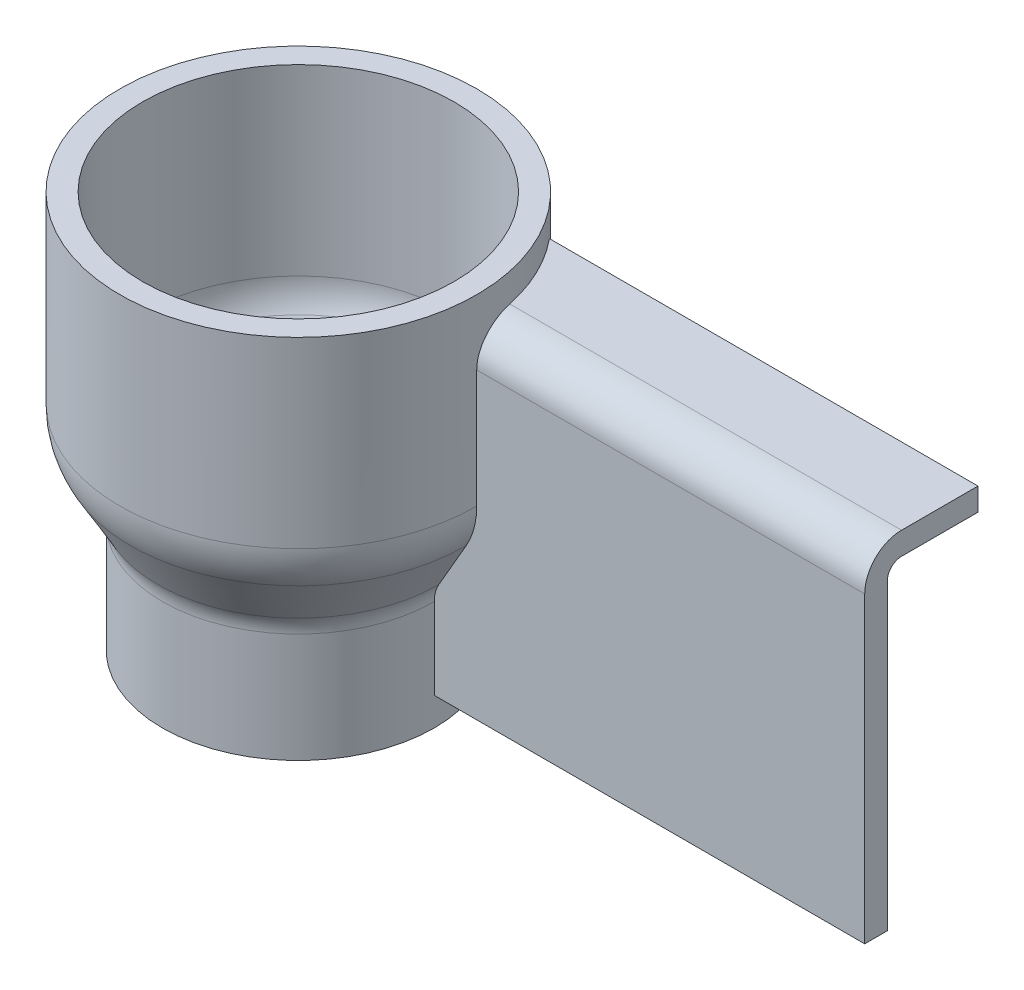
ISO-10303-21;
HEADER;
FILE_DESCRIPTION(('STEP AP214'),'2;1');
FILE_NAME('part.step','',(''),(''),'','','');
FILE_SCHEMA(('AUTOMOTIVE_DESIGN { 1 0 10303 214 1 1 1 1 }'));
ENDSEC;
DATA;
#1=APPLICATION_CONTEXT('core data for automotive mechanical design processes');
#2=APPLICATION_PROTOCOL_DEFINITION('international standard','automotive_design',2000,#1);
#3=PRODUCT_CONTEXT('',#1,'mechanical');
#4=PRODUCT('Part','Part','',(#3));
#5=PRODUCT_RELATED_PRODUCT_CATEGORY('part','',(#4));
#6=PRODUCT_DEFINITION_FORMATION('','',#4);
#7=PRODUCT_DEFINITION_CONTEXT('part definition',#1,'design');
#8=PRODUCT_DEFINITION('design','',#6,#7);
#9=PRODUCT_DEFINITION_SHAPE('','',#8);
#10=(LENGTH_UNIT() NAMED_UNIT(*) SI_UNIT(.MILLI.,.METRE.));
#11=(NAMED_UNIT(*) PLANE_ANGLE_UNIT() SI_UNIT($,.RADIAN.));
#12=(NAMED_UNIT(*) SI_UNIT($,.STERADIAN.) SOLID_ANGLE_UNIT());
#13=UNCERTAINTY_MEASURE_WITH_UNIT(LENGTH_MEASURE(1.E-05),#10,'distance_accuracy_value','');
#14=(GEOMETRIC_REPRESENTATION_CONTEXT(3) GLOBAL_UNCERTAINTY_ASSIGNED_CONTEXT((#13)) GLOBAL_UNIT_ASSIGNED_CONTEXT((#10,
#11,#12)) REPRESENTATION_CONTEXT('',''));
#15=CARTESIAN_POINT('',(0.,0.,0.));
#16=DIRECTION('',(0.,0.,1.));
#17=DIRECTION('',(1.,0.,0.));
#18=AXIS2_PLACEMENT_3D('',#15,#16,#17);
#19=CARTESIAN_POINT('',(0.,0.,0.));
#20=DIRECTION('',(0.,-1.,0.));
#21=DIRECTION('',(0.,0.,-1.));
#22=AXIS2_PLACEMENT_3D('',#19,#20,#21);
#23=CYLINDRICAL_SURFACE('',#22,30.48);
#24=CARTESIAN_POINT('',(0.,-88.9,0.));
#25=DIRECTION('',(0.,-1.,0.));
#26=DIRECTION('',(0.,0.,-1.));
#27=AXIS2_PLACEMENT_3D('',#24,#25,#26);
#28=CIRCLE('',#27,30.48);
#29=CARTESIAN_POINT('',(0.,-88.9,-30.48));
#30=VERTEX_POINT('',#29);
#31=EDGE_CURVE('E145',#30,#30,#28,.T.);
#32=ORIENTED_EDGE('',*,*,#31,.F.);
#33=EDGE_LOOP('',(#32));
#34=FACE_BOUND('',#33,.T.);
#35=DIRECTION('',(0.,-1.,0.));
#36=VECTOR('',#35,1.);
#37=CARTESIAN_POINT('',(30.48,0.,0.));
#38=LINE('',#37,#36);
#39=CARTESIAN_POINT('',(30.48,-82.55,0.));
#40=VERTEX_POINT('',#39);
#41=CARTESIAN_POINT('',(30.48,-64.3507386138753,0.));
#42=VERTEX_POINT('',#41);
#43=EDGE_CURVE('E134',#40,#42,#38,.F.);
#44=ORIENTED_EDGE('',*,*,#43,.T.);
#45=CARTESIAN_POINT('',(0.,-64.3507386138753,0.));
#46=DIRECTION('',(0.,-1.,0.));
#47=DIRECTION('',(0.,0.,-1.));
#48=AXIS2_PLACEMENT_3D('',#45,#46,#47);
#49=CIRCLE('',#48,30.48);
#50=CARTESIAN_POINT('',(30.053685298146,-64.3507386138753,-5.08));
#51=VERTEX_POINT('',#50);
#52=EDGE_CURVE('E11',#42,#51,#49,.T.);
#53=ORIENTED_EDGE('',*,*,#52,.T.);
#54=DIRECTION('',(0.,-1.,0.));
#55=VECTOR('',#54,1.);
#56=CARTESIAN_POINT('',(30.053685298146,0.,-5.08));
#57=LINE('',#56,#55);
#58=CARTESIAN_POINT('',(30.0536852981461,-82.55,-5.08000000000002));
#59=VERTEX_POINT('',#58);
#60=EDGE_CURVE('E116',#59,#51,#57,.F.);
#61=ORIENTED_EDGE('',*,*,#60,.F.);
#62=CARTESIAN_POINT('',(0.,-82.55,0.));
#63=DIRECTION('',(0.,1.,0.));
#64=DIRECTION('',(0.,0.,1.));
#65=AXIS2_PLACEMENT_3D('',#62,#63,#64);
#66=CIRCLE('',#65,30.48);
#67=EDGE_CURVE('E135',#59,#40,#66,.F.);
#68=ORIENTED_EDGE('',*,*,#67,.T.);
#69=EDGE_LOOP('',(#44,#53,#61,#68));
#70=FACE_BOUND('',#69,.T.);
#71=ADVANCED_FACE('F28',(#34,#70),#23,.T.);
#72=CARTESIAN_POINT('',(0.,-64.3507386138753,0.));
#73=DIRECTION('',(0.,-1.,0.));
#74=DIRECTION('',(0.,0.,-1.));
#75=AXIS2_PLACEMENT_3D('',#72,#73,#74);
#76=TOROIDAL_SURFACE('',#75,38.1,7.62);
#77=CARTESIAN_POINT('',(38.1,-64.3507386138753,0.));
#78=DIRECTION('',(0.,0.,-1.));
#79=DIRECTION('',(0.,1.,0.));
#80=AXIS2_PLACEMENT_3D('',#77,#78,#79);
#81=CIRCLE('',#80,7.62);
#82=CARTESIAN_POINT('',(31.5008864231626,-60.5407386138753,0.));
#83=VERTEX_POINT('',#82);
#84=EDGE_CURVE('E138',#42,#83,#81,.T.);
#85=ORIENTED_EDGE('',*,*,#84,.T.);
#86=CARTESIAN_POINT('',(0.,-60.5407386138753,0.));
#87=DIRECTION('',(0.,-1.,0.));
#88=DIRECTION('',(0.,0.,-1.));
#89=AXIS2_PLACEMENT_3D('',#86,#87,#88);
#90=CIRCLE('',#89,31.5008864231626);
#91=CARTESIAN_POINT('',(31.0885741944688,-60.5407386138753,-5.08000000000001));
#92=VERTEX_POINT('',#91);
#93=EDGE_CURVE('E35',#83,#92,#90,.T.);
#94=ORIENTED_EDGE('',*,*,#93,.T.);
#95=CARTESIAN_POINT('',(30.2561700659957,-62.6177870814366,-5.07999999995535));
#96=CARTESIAN_POINT('',(30.3053606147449,-62.4100595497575,-5.07999999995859));
#97=CARTESIAN_POINT('',(30.3633819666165,-62.2044459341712,-5.07999999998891));
#98=CARTESIAN_POINT('',(30.4966550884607,-61.7988052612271,-5.08000000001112));
#99=CARTESIAN_POINT('',(30.5719117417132,-61.5987798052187,-5.08000000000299));
#100=CARTESIAN_POINT('',(30.739139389,-61.2056188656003,-5.07999999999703));
#101=CARTESIAN_POINT('',(30.8311264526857,-61.0124902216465,-5.07999999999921));
#102=CARTESIAN_POINT('',(31.0310966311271,-60.6346087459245,-5.08000000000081));
#103=CARTESIAN_POINT('',(31.1390856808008,-60.4498590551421,-5.08000000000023));
#104=CARTESIAN_POINT('',(31.3700568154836,-60.0903442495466,-5.0799999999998));
#105=CARTESIAN_POINT('',(31.4930180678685,-59.9155657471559,-5.07999999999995));
#106=CARTESIAN_POINT('',(31.7531848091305,-59.5768524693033,-5.08000000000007));
#107=CARTESIAN_POINT('',(31.8903955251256,-59.4129217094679,-5.08000000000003));
#108=CARTESIAN_POINT('',(32.1779312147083,-59.0971814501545,-5.08));
#109=CARTESIAN_POINT('',(32.3282481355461,-58.9453646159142,-5.08000000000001));
#110=CARTESIAN_POINT('',(32.6410432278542,-58.6547042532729,-5.08000000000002));
#111=CARTESIAN_POINT('',(32.8035259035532,-58.5158655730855,-5.08000000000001));
#112=CARTESIAN_POINT('',(33.1409309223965,-58.2509853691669,-5.08000000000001));
#113=CARTESIAN_POINT('',(33.315950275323,-58.1250674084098,-5.08000000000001));
#114=CARTESIAN_POINT('',(33.6759574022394,-57.8882429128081,-5.08000000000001));
#115=CARTESIAN_POINT('',(33.8609488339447,-57.7773419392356,-5.08000000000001));
#116=CARTESIAN_POINT('',(34.2395132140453,-57.5713612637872,-5.08000000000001));
#117=CARTESIAN_POINT('',(34.433085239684,-57.4762798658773,-5.08000000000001));
#118=CARTESIAN_POINT('',(34.8274761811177,-57.3025602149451,-5.08000000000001));
#119=CARTESIAN_POINT('',(35.02829526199,-57.2239223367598,-5.08000000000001));
#120=CARTESIAN_POINT('',(35.4378093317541,-57.0829227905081,-5.08000000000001));
#121=CARTESIAN_POINT('',(35.646562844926,-57.0207310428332,-5.08000000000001));
#122=CARTESIAN_POINT('',(36.068560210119,-56.9140930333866,-5.08000000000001));
#123=CARTESIAN_POINT('',(36.2818041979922,-56.8696473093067,-5.08000000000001));
#124=CARTESIAN_POINT('',(36.7112361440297,-56.7988231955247,-5.08000000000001));
#125=CARTESIAN_POINT('',(36.9274236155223,-56.7724418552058,-5.08000000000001));
#126=CARTESIAN_POINT('',(37.3613257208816,-56.7379225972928,-5.08000000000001));
#127=CARTESIAN_POINT('',(37.579040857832,-56.7297910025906,-5.08000000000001));
#128=CARTESIAN_POINT('',(38.0150256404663,-56.7318647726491,-5.08000000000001));
#129=CARTESIAN_POINT('',(38.2332950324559,-56.742124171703,-5.08000000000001));
#130=CARTESIAN_POINT('',(38.6681920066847,-56.7810324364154,-5.08000000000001));
#131=CARTESIAN_POINT('',(38.8848195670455,-56.8096815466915,-5.08000000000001));
#132=CARTESIAN_POINT('',(39.3148731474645,-56.8851887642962,-5.08000000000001));
#133=CARTESIAN_POINT('',(39.5282992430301,-56.9320464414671,-5.08000000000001));
#134=CARTESIAN_POINT('',(39.9504228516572,-57.0436645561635,-5.08000000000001));
#135=CARTESIAN_POINT('',(40.1591202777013,-57.1084253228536,-5.08000000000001));
#136=CARTESIAN_POINT('',(40.5695504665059,-57.2551561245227,-5.08000000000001));
#137=CARTESIAN_POINT('',(40.7713050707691,-57.3370650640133,-5.08000000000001));
#138=CARTESIAN_POINT('',(41.1672243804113,-57.5177032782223,-5.08000000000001));
#139=CARTESIAN_POINT('',(41.3613864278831,-57.6164383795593,-5.08000000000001));
#140=CARTESIAN_POINT('',(41.7405939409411,-57.8300076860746,-5.08000000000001));
#141=CARTESIAN_POINT('',(41.925641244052,-57.9448386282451,-5.08000000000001));
#142=CARTESIAN_POINT('',(42.2853075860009,-58.1898157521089,-5.08000000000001));
#143=CARTESIAN_POINT('',(42.4599265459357,-58.3199620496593,-5.08000000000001));
#144=CARTESIAN_POINT('',(42.7962987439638,-58.5937192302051,-5.08000000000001));
#145=CARTESIAN_POINT('',(42.9581314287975,-58.7372324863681,-5.08000000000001));
#146=CARTESIAN_POINT('',(43.2690562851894,-59.0374534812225,-5.08000000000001));
#147=CARTESIAN_POINT('',(43.4181482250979,-59.1941614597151,-5.08000000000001));
#148=CARTESIAN_POINT('',(43.7024700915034,-59.51965333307,-5.08000000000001));
#149=CARTESIAN_POINT('',(43.8377029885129,-59.6884346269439,-5.08000000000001));
#150=CARTESIAN_POINT('',(44.0933521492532,-60.036861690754,-5.08000000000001));
#151=CARTESIAN_POINT('',(44.2137632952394,-60.2165111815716,-5.08000000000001));
#152=CARTESIAN_POINT('',(44.5497016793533,-60.7672771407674,-5.08000000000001));
#153=CARTESIAN_POINT('',(44.7422905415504,-61.1529146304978,-5.08000000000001));
#154=CARTESIAN_POINT('',(44.9800557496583,-61.7509441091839,-5.08000000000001));
#155=CARTESIAN_POINT('',(45.0508105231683,-61.9536407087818,-5.08000000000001));
#156=CARTESIAN_POINT('',(45.1749219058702,-62.3643192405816,-5.08000000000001));
#157=CARTESIAN_POINT('',(45.2282781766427,-62.5723012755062,-5.08000000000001));
#158=CARTESIAN_POINT('',(45.3610296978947,-63.1996301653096,-5.08000000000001));
#159=CARTESIAN_POINT('',(45.4140977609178,-63.6248597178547,-5.08000000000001));
#160=CARTESIAN_POINT('',(45.4478694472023,-64.4779769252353,-5.08000000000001));
#161=CARTESIAN_POINT('',(45.4285743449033,-64.9058645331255,-5.08000000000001));
#162=CARTESIAN_POINT('',(45.3184326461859,-65.7513451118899,-5.08000000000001));
#163=CARTESIAN_POINT('',(45.2277469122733,-66.1689590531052,-5.08000000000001));
#164=CARTESIAN_POINT('',(44.9775091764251,-66.9832258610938,-5.08000000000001));
#165=CARTESIAN_POINT('',(44.8179571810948,-67.3798787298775,-5.08000000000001));
#166=CARTESIAN_POINT('',(44.5306616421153,-67.9505219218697,-5.08000000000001));
#167=CARTESIAN_POINT('',(44.4267686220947,-68.1368615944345,-5.08000000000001));
#168=CARTESIAN_POINT('',(44.2037444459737,-68.500156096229,-5.08000000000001));
#169=CARTESIAN_POINT('',(44.0846136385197,-68.6771111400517,-5.08000000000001));
#170=CARTESIAN_POINT('',(43.7054719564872,-69.1920419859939,-5.08000000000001));
#171=CARTESIAN_POINT('',(43.4235456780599,-69.5144127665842,-5.08000000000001));
#172=CARTESIAN_POINT('',(42.9631693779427,-69.9595979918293,-5.08000000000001));
#173=CARTESIAN_POINT('',(42.8029777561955,-70.1019307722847,-5.08000000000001));
#174=CARTESIAN_POINT('',(42.4712371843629,-70.3726816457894,-5.08000000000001));
#175=CARTESIAN_POINT('',(42.2996923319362,-70.501104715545,-5.08000000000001));
#176=CARTESIAN_POINT('',(41.9464101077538,-70.7431799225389,-5.08000000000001));
#177=CARTESIAN_POINT('',(41.7646689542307,-70.8568265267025,-5.08000000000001));
#178=CARTESIAN_POINT('',(41.3923901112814,-71.0685122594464,-5.08000000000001));
#179=CARTESIAN_POINT('',(41.2018553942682,-71.1665566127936,-5.08000000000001));
#180=CARTESIAN_POINT('',(40.8119448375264,-71.3470419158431,-5.08000000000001));
#181=CARTESIAN_POINT('',(40.6125172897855,-71.4293711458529,-5.08000000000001));
#182=CARTESIAN_POINT('',(40.2074722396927,-71.577035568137,-5.08000000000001));
#183=CARTESIAN_POINT('',(40.0018548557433,-71.642371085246,-5.08000000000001));
#184=CARTESIAN_POINT('',(39.5858681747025,-71.7556239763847,-5.08000000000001));
#185=CARTESIAN_POINT('',(39.3754986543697,-71.8035405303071,-5.08000000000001));
#186=CARTESIAN_POINT('',(38.9514966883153,-71.8816435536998,-5.08000000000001));
#187=CARTESIAN_POINT('',(38.7378642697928,-71.9118301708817,-5.08000000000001));
#188=CARTESIAN_POINT('',(38.3072440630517,-71.9544445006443,-5.08000000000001));
#189=CARTESIAN_POINT('',(38.0902431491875,-71.9667396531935,-5.08000000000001));
#190=CARTESIAN_POINT('',(37.6560539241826,-71.973081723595,-5.08000000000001));
#191=CARTESIAN_POINT('',(37.4388657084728,-71.9671352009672,-5.08000000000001));
#192=CARTESIAN_POINT('',(37.0056675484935,-71.9370591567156,-5.08000000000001));
#193=CARTESIAN_POINT('',(36.7896580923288,-71.9129226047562,-5.08000000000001));
#194=CARTESIAN_POINT('',(36.3604948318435,-71.8466477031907,-5.08000000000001));
#195=CARTESIAN_POINT('',(36.1473400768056,-71.8045155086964,-5.08000000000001));
#196=CARTESIAN_POINT('',(35.7242314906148,-71.7022868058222,-5.08000000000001));
#197=CARTESIAN_POINT('',(35.5142995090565,-71.6420998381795,-5.08000000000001));
#198=CARTESIAN_POINT('',(35.1002538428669,-71.5042622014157,-5.08000000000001));
#199=CARTESIAN_POINT('',(34.8961400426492,-71.426611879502,-5.08000000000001));
#200=CARTESIAN_POINT('',(34.4951753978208,-71.2543802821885,-5.08000000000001));
#201=CARTESIAN_POINT('',(34.2983248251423,-71.1597983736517,-5.08000000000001));
#202=CARTESIAN_POINT('',(33.9133125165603,-70.9543586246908,-5.08000000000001));
#203=CARTESIAN_POINT('',(33.7251506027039,-70.8435011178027,-5.08000000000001));
#204=CARTESIAN_POINT('',(33.3589446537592,-70.6063171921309,-5.08000000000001));
#205=CARTESIAN_POINT('',(33.1808967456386,-70.4799967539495,-5.08000000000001));
#206=CARTESIAN_POINT('',(32.8362079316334,-70.2127747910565,-5.08000000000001));
#207=CARTESIAN_POINT('',(32.6695627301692,-70.0718788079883,-5.08000000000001));
#208=CARTESIAN_POINT('',(32.3487876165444,-69.7763954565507,-5.08000000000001));
#209=CARTESIAN_POINT('',(32.1946617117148,-69.621803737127,-5.08000000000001));
#210=CARTESIAN_POINT('',(31.9001990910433,-69.3001098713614,-5.08000000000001));
#211=CARTESIAN_POINT('',(31.7598570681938,-69.1330125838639,-5.08000000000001));
#212=CARTESIAN_POINT('',(31.4949825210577,-68.7887571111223,-5.08000000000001));
#213=CARTESIAN_POINT('',(31.3703373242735,-68.6116856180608,-5.08000000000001));
#214=CARTESIAN_POINT('',(31.1366073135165,-68.2476433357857,-5.08000000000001));
#215=CARTESIAN_POINT('',(31.0275168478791,-68.0606761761,-5.08000000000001));
#216=CARTESIAN_POINT('',(30.8256498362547,-67.6780392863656,-5.08000000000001));
#217=CARTESIAN_POINT('',(30.7328795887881,-67.4823662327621,-5.08000000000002));
#218=CARTESIAN_POINT('',(30.5644377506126,-67.0837975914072,-5.08000000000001));
#219=CARTESIAN_POINT('',(30.4887657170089,-66.8809021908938,-5.08));
#220=CARTESIAN_POINT('',(30.3559263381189,-66.4718377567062,-5.08000000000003));
#221=CARTESIAN_POINT('',(30.2985474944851,-66.2657373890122,-5.08000000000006));
#222=CARTESIAN_POINT('',(30.2015211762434,-65.8494084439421,-5.07999999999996));
#223=CARTESIAN_POINT('',(30.161873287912,-65.6391799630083,-5.07999999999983));
#224=CARTESIAN_POINT('',(30.1006592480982,-65.2163508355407,-5.0800000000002));
#225=CARTESIAN_POINT('',(30.0790723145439,-65.0037532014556,-5.08000000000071));
#226=CARTESIAN_POINT('',(30.0540774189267,-64.5775629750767,-5.07999999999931));
#227=CARTESIAN_POINT('',(30.0506643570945,-64.363970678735,-5.0799999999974));
#228=CARTESIAN_POINT('',(30.0632271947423,-63.8926246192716,-5.08000000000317));
#229=CARTESIAN_POINT('',(30.0834053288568,-63.634972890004,-5.08000000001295));
#230=CARTESIAN_POINT('',(30.1501440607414,-63.1231133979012,-5.07999999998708));
#231=CARTESIAN_POINT('',(30.1967043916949,-62.8689056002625,-5.07999999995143));
#232=CARTESIAN_POINT('',(30.2561700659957,-62.6177870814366,-5.07999999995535));
#233=B_SPLINE_CURVE_WITH_KNOTS('',3,(#95,#96,#97,#98,#99,#100,#101,#102,#103,#104,#105,#106,
#107,#108,#109,#110,#111,#112,#113,#114,#115,#116,#117,#118,#119,#120,#121,#122,#123,#124,#125,
#126,#127,#128,#129,#130,#131,#132,#133,#134,#135,#136,#137,#138,#139,#140,#141,#142,#143,#144,
#145,#146,#147,#148,#149,#150,#151,#152,#153,#154,#155,#156,#157,#158,#159,#160,#161,#162,#163,
#164,#165,#166,#167,#168,#169,#170,#171,#172,#173,#174,#175,#176,#177,#178,#179,#180,#181,#182,
#183,#184,#185,#186,#187,#188,#189,#190,#191,#192,#193,#194,#195,#196,#197,#198,#199,#200,#201,
#202,#203,#204,#205,#206,#207,#208,#209,#210,#211,#212,#213,#214,#215,#216,#217,#218,#219,#220,
#221,#222,#223,#224,#225,#226,#227,#228,#229,#230,#231,#232),.UNSPECIFIED.,.T.,.F.,(4,2,2,2,2,2,
2,2,2,2,2,2,2,2,2,2,2,2,2,2,2,2,2,2,2,2,2,2,2,2,2,2,2,2,2,2,2,2,2,2,2,2,2,2,2,2,2,2,2,2,2,2,2,2,
2,2,2,2,2,2,2,2,2,2,2,2,2,2,4),(0.,0.640187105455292,1.28055582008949,1.92154289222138,
2.56276829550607,3.20311146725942,3.84369037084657,4.48387842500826,5.12430468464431,
5.77037494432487,6.41668381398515,7.06292334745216,7.70917761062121,8.36186886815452,
9.01457990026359,9.66718429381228,10.3200147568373,10.9747664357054,11.6295268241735,
12.2842717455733,12.9390287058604,13.5914914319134,14.2441805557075,14.8967375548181,
15.549299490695,16.1974218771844,16.8455560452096,17.4935510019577,18.1417690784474,
19.4275768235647,20.0710334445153,20.7145025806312,21.9934784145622,23.2724317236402,
24.5485114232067,25.8245910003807,26.4639636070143,27.1033215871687,28.3809444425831,
29.0232435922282,29.6653121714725,30.3076204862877,30.9497132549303,31.5962132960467,
32.2427009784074,32.8892190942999,33.5357318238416,34.1870106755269,34.8380553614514,
35.4893518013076,36.1404256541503,36.7948176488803,37.4491966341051,38.1036000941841,
38.7579901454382,39.4121278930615,40.0660178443,40.720116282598,41.3739618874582,
42.0228083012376,42.6714183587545,43.3202781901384,43.9691212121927,44.6101649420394,
45.2511937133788,45.8914838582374,46.5315943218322,47.3055141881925,48.0794262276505),.UNSPECIFIED.);
#234=EDGE_CURVE('E119',#51,#92,#233,.T.);
#235=ORIENTED_EDGE('',*,*,#234,.F.);
#236=ORIENTED_EDGE('',*,*,#52,.F.);
#237=EDGE_LOOP('',(#85,#94,#235,#236));
#238=FACE_BOUND('',#237,.T.);
#239=ADVANCED_FACE('F129',(#238),#76,.F.);
#240=CARTESIAN_POINT('',(0.,-49.9370451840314,0.));
#241=DIRECTION('',(0.,1.,0.));
#242=DIRECTION('',(0.,0.,1.));
#243=AXIS2_PLACEMENT_3D('',#240,#241,#242);
#244=CONICAL_SURFACE('',#243,37.6229316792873,0.523598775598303);
#245=DIRECTION('',(-0.500000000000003,-0.866025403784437,0.));
#246=VECTOR('',#245,1.);
#247=CARTESIAN_POINT('',(0.,-115.101874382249,0.));
#248=LINE('',#247,#246);
#249=CARTESIAN_POINT('',(37.6229316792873,-49.9370451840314,0.));
#250=VERTEX_POINT('',#249);
#251=EDGE_CURVE('E140',#83,#250,#248,.F.);
#252=ORIENTED_EDGE('',*,*,#251,.T.);
#253=CARTESIAN_POINT('',(0.,-49.9370451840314,0.));
#254=DIRECTION('',(0.,-1.,0.));
#255=DIRECTION('',(0.,0.,-1.));
#256=AXIS2_PLACEMENT_3D('',#253,#254,#255);
#257=CIRCLE('',#256,37.6229316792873);
#258=CARTESIAN_POINT('',(37.2783930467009,-49.9370451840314,-5.08000000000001));
#259=VERTEX_POINT('',#258);
#260=EDGE_CURVE('E173',#250,#259,#257,.T.);
#261=ORIENTED_EDGE('',*,*,#260,.T.);
#262=CARTESIAN_POINT('',(10.0107049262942,-95.6580620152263,-5.08000000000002));
#263=CARTESIAN_POINT('',(10.1802367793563,-95.3962010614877,-5.08000000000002));
#264=CARTESIAN_POINT('',(10.3491553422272,-95.133944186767,-5.08000000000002));
#265=CARTESIAN_POINT('',(10.6859054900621,-94.6087349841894,-5.08000000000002));
#266=CARTESIAN_POINT('',(10.8537370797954,-94.345782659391,-5.08000000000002));
#267=CARTESIAN_POINT('',(11.3558067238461,-93.5560335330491,-5.08000000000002));
#268=CARTESIAN_POINT('',(11.6886260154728,-93.028334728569,-5.08000000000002));
#269=CARTESIAN_POINT('',(12.351286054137,-91.9711120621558,-5.08000000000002));
#270=CARTESIAN_POINT('',(12.6811269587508,-91.4415882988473,-5.08000000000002));
#271=CARTESIAN_POINT('',(13.3384379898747,-90.3810682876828,-5.08000000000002));
#272=CARTESIAN_POINT('',(13.6659081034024,-89.8500720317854,-5.08000000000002));
#273=CARTESIAN_POINT('',(14.6453908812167,-88.255427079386,-5.08000000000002));
#274=CARTESIAN_POINT('',(15.2945398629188,-87.1900198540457,-5.08000000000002));
#275=CARTESIAN_POINT('',(16.5876286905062,-85.0560304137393,-5.08000000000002));
#276=CARTESIAN_POINT('',(17.2315684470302,-83.9874481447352,-5.08000000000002));
#277=CARTESIAN_POINT('',(18.497768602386,-81.8778727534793,-5.08000000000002));
#278=CARTESIAN_POINT('',(19.1201325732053,-80.836941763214,-5.08000000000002));
#279=CARTESIAN_POINT('',(20.3621983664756,-78.7534926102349,-5.08000000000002));
#280=CARTESIAN_POINT('',(20.9819001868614,-77.7109744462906,-5.08000000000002));
#281=CARTESIAN_POINT('',(22.2192550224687,-75.6247300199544,-5.08000000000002));
#282=CARTESIAN_POINT('',(22.8369080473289,-74.5810037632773,-5.08000000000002));
#283=CARTESIAN_POINT('',(24.0706044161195,-72.492600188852,-5.08000000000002));
#284=CARTESIAN_POINT('',(24.6866477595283,-71.4479228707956,-5.08000000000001));
#285=CARTESIAN_POINT('',(26.5329735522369,-68.3125818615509,-5.08000000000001));
#286=CARTESIAN_POINT('',(27.7613434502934,-66.2207920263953,-5.08000000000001));
#287=CARTESIAN_POINT('',(30.2146947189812,-62.0352259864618,-5.08000000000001));
#288=CARTESIAN_POINT('',(31.4396760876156,-59.9414497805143,-5.08000000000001));
#289=CARTESIAN_POINT('',(33.5900067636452,-56.2612054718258,-5.08000000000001));
#290=CARTESIAN_POINT('',(34.5158678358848,-54.6750363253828,-5.08000000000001));
#291=CARTESIAN_POINT('',(36.3665048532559,-51.5020658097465,-5.08000000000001));
#292=CARTESIAN_POINT('',(37.2912807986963,-49.9152644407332,-5.08000000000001));
#293=CARTESIAN_POINT('',(40.0643222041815,-45.1541101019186,-5.08000000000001));
#294=CARTESIAN_POINT('',(41.9113007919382,-41.9790076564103,-5.08000000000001));
#295=CARTESIAN_POINT('',(45.6026640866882,-35.6280211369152,-5.08000000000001));
#296=CARTESIAN_POINT('',(47.447049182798,-32.4521372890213,-5.08000000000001));
#297=CARTESIAN_POINT('',(50.2124178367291,-27.6876115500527,-5.08000000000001));
#298=CARTESIAN_POINT('',(51.134005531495,-26.0993202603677,-5.08000000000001));
#299=CARTESIAN_POINT('',(52.9768345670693,-22.9225368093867,-5.08000000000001));
#300=CARTESIAN_POINT('',(53.8980759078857,-21.3340446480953,-5.08000000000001));
#301=CARTESIAN_POINT('',(54.8191722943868,-19.7454684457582,-5.08000000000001));
#302=B_SPLINE_CURVE_WITH_KNOTS('',3,(#262,#263,#264,#265,#266,#267,#268,#269,#270,#271,#272,
#273,#274,#275,#276,#277,#278,#279,#280,#281,#282,#283,#284,#285,#286,#287,#288,#289,#290,#291,
#292,#293,#294,#295,#296,#297,#298,#299,#300,#301),.UNSPECIFIED.,.F.,.F.,(4,2,2,2,2,2,2,2,2,2,2,
2,2,2,2,2,2,2,2,4),(0.,0.935844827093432,1.87168554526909,3.74333180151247,5.61487844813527,
7.4864353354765,11.2291871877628,14.9720031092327,18.6103858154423,22.2487713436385,
25.8871397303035,29.5255092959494,36.8028861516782,44.0802672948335,49.5901090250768,
55.0999491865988,66.119632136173,77.13743313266,82.6463293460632,88.1552254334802),.UNSPECIFIED.);
#303=EDGE_CURVE('E131',#92,#259,#302,.T.);
#304=ORIENTED_EDGE('',*,*,#303,.F.);
#305=ORIENTED_EDGE('',*,*,#93,.F.);
#306=EDGE_LOOP('',(#252,#261,#304,#305));
#307=FACE_BOUND('',#306,.T.);
#308=ADVANCED_FACE('F178',(#307),#244,.T.);
#309=CARTESIAN_POINT('',(0.,-41.0470451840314,0.));
#310=DIRECTION('',(0.,-1.,0.));
#311=DIRECTION('',(0.,0.,-1.));
#312=AXIS2_PLACEMENT_3D('',#309,#310,#311);
#313=TOROIDAL_SURFACE('',#312,22.225,17.78);
#314=CARTESIAN_POINT('',(22.225,-41.0470451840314,0.));
#315=DIRECTION('',(0.,0.,-1.));
#316=DIRECTION('',(0.,1.,0.));
#317=AXIS2_PLACEMENT_3D('',#314,#315,#316);
#318=CIRCLE('',#317,17.78);
#319=CARTESIAN_POINT('',(40.005,-41.0470451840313,0.));
#320=VERTEX_POINT('',#319);
#321=EDGE_CURVE('E183',#250,#320,#318,.F.);
#322=ORIENTED_EDGE('',*,*,#321,.T.);
#323=CARTESIAN_POINT('',(0.,-41.0470451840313,0.));
#324=DIRECTION('',(0.,-1.,0.));
#325=DIRECTION('',(0.,0.,-1.));
#326=AXIS2_PLACEMENT_3D('',#323,#324,#325);
#327=CIRCLE('',#326,40.005);
#328=CARTESIAN_POINT('',(39.6811494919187,-41.0470451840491,-5.08000000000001));
#329=VERTEX_POINT('',#328);
#330=EDGE_CURVE('E170',#320,#329,#327,.T.);
#331=ORIENTED_EDGE('',*,*,#330,.T.);
#332=CARTESIAN_POINT('',(0.,-45.7563312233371,-5.08000000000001));
#333=CARTESIAN_POINT('',(0.100210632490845,-45.7563642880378,-5.08000000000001));
#334=CARTESIAN_POINT('',(0.200596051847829,-45.7673858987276,-5.08000000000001));
#335=CARTESIAN_POINT('',(0.39725557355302,-45.8090280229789,-5.08000000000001));
#336=CARTESIAN_POINT('',(0.493513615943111,-45.8397187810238,-5.08000000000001));
#337=CARTESIAN_POINT('',(0.654100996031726,-45.9049739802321,-5.08000000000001));
#338=CARTESIAN_POINT('',(0.719892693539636,-45.9361143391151,-5.08000000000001));
#339=CARTESIAN_POINT('',(0.848449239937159,-46.0041744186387,-5.08000000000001));
#340=CARTESIAN_POINT('',(0.911211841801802,-46.0410983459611,-5.08000000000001));
#341=CARTESIAN_POINT('',(1.03415365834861,-46.1194201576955,-5.08000000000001));
#342=CARTESIAN_POINT('',(1.09432288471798,-46.1608334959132,-5.08000000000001));
#343=CARTESIAN_POINT('',(1.21219687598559,-46.2469473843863,-5.08000000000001));
#344=CARTESIAN_POINT('',(1.26990273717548,-46.2916464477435,-5.08000000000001));
#345=CARTESIAN_POINT('',(1.44695248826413,-46.4351424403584,-5.08000000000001));
#346=CARTESIAN_POINT('',(1.56273352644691,-46.5383146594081,-5.08000000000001));
#347=CARTESIAN_POINT('',(1.78815510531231,-46.7512082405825,-5.08000000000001));
#348=CARTESIAN_POINT('',(1.89778918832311,-46.8609362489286,-5.08000000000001));
#349=CARTESIAN_POINT('',(2.11318325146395,-47.0846811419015,-5.08000000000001));
#350=CARTESIAN_POINT('',(2.21893192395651,-47.1987088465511,-5.08000000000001));
#351=CARTESIAN_POINT('',(2.42769506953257,-47.429244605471,-5.08000000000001));
#352=CARTESIAN_POINT('',(2.53070918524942,-47.5457529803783,-5.08000000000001));
#353=CARTESIAN_POINT('',(2.73559559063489,-47.780929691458,-5.08000000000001));
#354=CARTESIAN_POINT('',(2.83745807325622,-47.8996065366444,-5.08000000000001));
#355=CARTESIAN_POINT('',(3.04020970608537,-48.1378040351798,-5.08000000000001));
#356=CARTESIAN_POINT('',(3.14109876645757,-48.2573247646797,-5.08000000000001));
#357=CARTESIAN_POINT('',(3.34229727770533,-48.4965149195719,-5.08000000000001));
#358=CARTESIAN_POINT('',(3.44260741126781,-48.6161837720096,-5.08000000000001));
#359=CARTESIAN_POINT('',(3.64325008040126,-48.8555007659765,-5.08000000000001));
#360=CARTESIAN_POINT('',(3.74358261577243,-48.9751489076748,-5.08000000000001));
#361=CARTESIAN_POINT('',(3.97590477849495,-49.2513287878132,-5.08000000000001));
#362=CARTESIAN_POINT('',(4.10802748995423,-49.4077490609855,-5.08000000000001));
#363=CARTESIAN_POINT('',(4.37350416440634,-49.7195359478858,-5.08000000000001));
#364=CARTESIAN_POINT('',(4.50685810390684,-49.87490258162,-5.08000000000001));
#365=CARTESIAN_POINT('',(4.90948533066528,-50.3387846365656,-5.08000000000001));
#366=CARTESIAN_POINT('',(5.18132899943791,-50.6450882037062,-5.08000000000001));
#367=CARTESIAN_POINT('',(5.73457377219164,-51.2492408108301,-5.08000000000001));
#368=CARTESIAN_POINT('',(6.01597922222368,-51.5470858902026,-5.08000000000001));
#369=CARTESIAN_POINT('',(6.58977725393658,-52.1319871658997,-5.08000000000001));
#370=CARTESIAN_POINT('',(6.88216885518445,-52.4190443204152,-5.08000000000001));
#371=CARTESIAN_POINT('',(7.47742572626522,-52.9790715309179,-5.08000000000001));
#372=CARTESIAN_POINT('',(7.78023126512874,-53.2521048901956,-5.08000000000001));
#373=CARTESIAN_POINT('',(8.398172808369,-53.7838896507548,-5.08000000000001));
#374=CARTESIAN_POINT('',(8.71330908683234,-54.0426407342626,-5.08000000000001));
#375=CARTESIAN_POINT('',(9.35597071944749,-54.5441950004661,-5.08000000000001));
#376=CARTESIAN_POINT('',(9.68349392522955,-54.7870009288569,-5.08000000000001));
#377=CARTESIAN_POINT('',(10.3507319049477,-55.2551603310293,-5.08000000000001));
#378=CARTESIAN_POINT('',(10.690445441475,-55.4805155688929,-5.08000000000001));
#379=CARTESIAN_POINT('',(11.5175034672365,-55.997240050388,-5.08000000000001));
#380=CARTESIAN_POINT('',(12.0104223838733,-56.2797691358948,-5.08000000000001));
#381=CARTESIAN_POINT('',(13.0171004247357,-56.8046469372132,-5.08000000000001));
#382=CARTESIAN_POINT('',(13.5308553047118,-57.0470037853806,-5.08000000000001));
#383=CARTESIAN_POINT('',(14.577259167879,-57.4887472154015,-5.08000000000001));
#384=CARTESIAN_POINT('',(15.1099289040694,-57.6880847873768,-5.08000000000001));
#385=CARTESIAN_POINT('',(16.1903605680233,-58.0407327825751,-5.08000000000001));
#386=CARTESIAN_POINT('',(16.7381233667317,-58.19404054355,-5.08000000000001));
#387=CARTESIAN_POINT('',(17.8469240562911,-58.4528356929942,-5.08000000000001));
#388=CARTESIAN_POINT('',(18.4080023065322,-58.5581506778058,-5.08000000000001));
#389=CARTESIAN_POINT('',(19.537336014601,-58.7183957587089,-5.08000000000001));
#390=CARTESIAN_POINT('',(20.1055914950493,-58.7733256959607,-5.08000000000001));
#391=CARTESIAN_POINT('',(21.2446122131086,-58.8315669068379,-5.08000000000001));
#392=CARTESIAN_POINT('',(21.8153767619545,-58.8348915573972,-5.08000000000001));
#393=CARTESIAN_POINT('',(22.9548112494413,-58.7892736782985,-5.08000000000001));
#394=CARTESIAN_POINT('',(23.5234813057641,-58.7403341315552,-5.08000000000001));
#395=CARTESIAN_POINT('',(24.6172876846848,-58.5949379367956,-5.08000000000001));
#396=CARTESIAN_POINT('',(25.1428615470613,-58.5017579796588,-5.08000000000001));
#397=CARTESIAN_POINT('',(26.1838785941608,-58.269918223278,-5.08000000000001));
#398=CARTESIAN_POINT('',(26.6993222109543,-58.1312603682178,-5.08000000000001));
#399=CARTESIAN_POINT('',(27.7159541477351,-57.8092539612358,-5.08000000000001));
#400=CARTESIAN_POINT('',(28.2171451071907,-57.6259137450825,-5.08000000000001));
#401=CARTESIAN_POINT('',(29.2013874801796,-57.215701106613,-5.08000000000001));
#402=CARTESIAN_POINT('',(29.6844392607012,-56.9888295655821,-5.08000000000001));
#403=CARTESIAN_POINT('',(30.6101880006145,-56.5027579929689,-5.08000000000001));
#404=CARTESIAN_POINT('',(31.0537235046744,-56.2451535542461,-5.08000000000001));
#405=CARTESIAN_POINT('',(31.9171117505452,-55.6929254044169,-5.08000000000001));
#406=CARTESIAN_POINT('',(32.3369651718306,-55.3983027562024,-5.08000000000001));
#407=CARTESIAN_POINT('',(33.1497804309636,-54.7741148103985,-5.08000000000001));
#408=CARTESIAN_POINT('',(33.5427447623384,-54.4445527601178,-5.08000000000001));
#409=CARTESIAN_POINT('',(34.2988334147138,-53.7528085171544,-5.08000000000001));
#410=CARTESIAN_POINT('',(34.6619579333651,-53.3906265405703,-5.08000000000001));
#411=CARTESIAN_POINT('',(35.3492405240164,-52.6431698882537,-5.08000000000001));
#412=CARTESIAN_POINT('',(35.6739896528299,-52.2584385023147,-5.08000000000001));
#413=CARTESIAN_POINT('',(36.2896430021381,-51.4627899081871,-5.08000000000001));
#414=CARTESIAN_POINT('',(36.5805476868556,-51.0518730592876,-5.08000000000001));
#415=CARTESIAN_POINT('',(37.1263396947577,-50.2068016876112,-5.08000000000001));
#416=CARTESIAN_POINT('',(37.3812285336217,-49.7726481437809,-5.08000000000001));
#417=CARTESIAN_POINT('',(37.8531028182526,-48.8842080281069,-5.08000000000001));
#418=CARTESIAN_POINT('',(38.0700883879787,-48.4299215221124,-5.08000000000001));
#419=CARTESIAN_POINT('',(38.4627266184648,-47.5087431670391,-5.08000000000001));
#420=CARTESIAN_POINT('',(38.6387396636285,-47.042004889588,-5.08000000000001));
#421=CARTESIAN_POINT('',(38.9506678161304,-46.0953175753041,-5.08000000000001));
#422=CARTESIAN_POINT('',(39.0865831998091,-45.61536862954,-5.08000000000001));
#423=CARTESIAN_POINT('',(39.3173136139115,-44.6457022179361,-5.08000000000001));
#424=CARTESIAN_POINT('',(39.4121295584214,-44.1559849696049,-5.08000000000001));
#425=CARTESIAN_POINT('',(39.5599668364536,-43.1702815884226,-5.08000000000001));
#426=CARTESIAN_POINT('',(39.6129882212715,-42.6742954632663,-5.08000000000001));
#427=CARTESIAN_POINT('',(39.6767123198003,-41.6816934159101,-5.08000000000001));
#428=CARTESIAN_POINT('',(39.6875907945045,-41.1850887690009,-5.08000000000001));
#429=CARTESIAN_POINT('',(39.6674348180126,-40.1927319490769,-5.08000000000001));
#430=CARTESIAN_POINT('',(39.6364005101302,-39.696979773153,-5.08000000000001));
#431=CARTESIAN_POINT('',(39.5326465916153,-38.7098621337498,-5.08000000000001));
#432=CARTESIAN_POINT('',(39.4599273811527,-38.218496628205,-5.08000000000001));
#433=CARTESIAN_POINT('',(39.2733355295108,-37.2436427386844,-5.08000000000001));
#434=CARTESIAN_POINT('',(39.1594628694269,-36.7601543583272,-5.08000000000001));
#435=CARTESIAN_POINT('',(38.8914926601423,-35.8048332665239,-5.08000000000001));
#436=CARTESIAN_POINT('',(38.737424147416,-35.3329924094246,-5.08000000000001));
#437=CARTESIAN_POINT('',(38.3901464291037,-34.4039431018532,-5.08000000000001));
#438=CARTESIAN_POINT('',(38.1969372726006,-33.9467346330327,-5.08000000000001));
#439=CARTESIAN_POINT('',(37.7727839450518,-33.0501720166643,-5.08000000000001));
#440=CARTESIAN_POINT('',(37.5418398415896,-32.6108178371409,-5.08000000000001));
#441=CARTESIAN_POINT('',(37.0438926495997,-31.7530429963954,-5.08000000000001));
#442=CARTESIAN_POINT('',(36.7768894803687,-31.3346223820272,-5.08000000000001));
#443=CARTESIAN_POINT('',(36.2080556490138,-30.5206263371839,-5.08000000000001));
#444=CARTESIAN_POINT('',(35.9061406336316,-30.1251098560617,-5.08000000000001));
#445=CARTESIAN_POINT('',(35.2702065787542,-29.3607914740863,-5.08000000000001));
#446=CARTESIAN_POINT('',(34.9361875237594,-28.9919895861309,-5.08000000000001));
#447=CARTESIAN_POINT('',(34.2384553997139,-28.2836305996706,-5.08000000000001));
#448=CARTESIAN_POINT('',(33.8747420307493,-27.9440737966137,-5.08000000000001));
#449=CARTESIAN_POINT('',(33.1202399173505,-27.296509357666,-5.08000000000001));
#450=CARTESIAN_POINT('',(32.7294510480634,-26.9885018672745,-5.08000000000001));
#451=CARTESIAN_POINT('',(31.9209954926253,-26.4042087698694,-5.08000000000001));
#452=CARTESIAN_POINT('',(31.5031718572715,-26.1281403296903,-5.08000000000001));
#453=CARTESIAN_POINT('',(30.6459385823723,-25.6118524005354,-5.08000000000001));
#454=CARTESIAN_POINT('',(30.2065288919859,-25.3716329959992,-5.08000000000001));
#455=CARTESIAN_POINT('',(29.309258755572,-24.9285658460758,-5.08000000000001));
#456=CARTESIAN_POINT('',(28.851398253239,-24.7257182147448,-5.08000000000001));
#457=CARTESIAN_POINT('',(27.920462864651,-24.3586142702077,-5.08000000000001));
#458=CARTESIAN_POINT('',(27.4473878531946,-24.1943582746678,-5.08000000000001));
#459=CARTESIAN_POINT('',(26.4832458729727,-23.9035102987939,-5.08000000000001));
#460=CARTESIAN_POINT('',(25.9920267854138,-23.7774226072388,-5.08000000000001));
#461=CARTESIAN_POINT('',(25.0008419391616,-23.5663594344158,-5.08000000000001));
#462=CARTESIAN_POINT('',(24.5008761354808,-23.481384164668,-5.08000000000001));
#463=CARTESIAN_POINT('',(23.4956309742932,-23.3528016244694,-5.08000000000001));
#464=CARTESIAN_POINT('',(22.9903513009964,-23.309196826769,-5.08000000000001));
#465=CARTESIAN_POINT('',(21.9779264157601,-23.2632759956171,-5.08000000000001));
#466=CARTESIAN_POINT('',(21.4707811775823,-23.2609605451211,-5.08000000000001));
#467=CARTESIAN_POINT('',(20.4455668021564,-23.2976318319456,-5.08000000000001));
#468=CARTESIAN_POINT('',(19.9275338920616,-23.3376302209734,-5.08000000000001));
#469=CARTESIAN_POINT('',(18.8964596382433,-23.4596732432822,-5.08000000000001));
#470=CARTESIAN_POINT('',(18.383418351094,-23.5417183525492,-5.08000000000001));
#471=CARTESIAN_POINT('',(17.3656112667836,-23.7466433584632,-5.08000000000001));
#472=CARTESIAN_POINT('',(16.8608449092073,-23.8695204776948,-5.08000000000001));
#473=CARTESIAN_POINT('',(15.8625457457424,-24.1545508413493,-5.08000000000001));
#474=CARTESIAN_POINT('',(15.3690131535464,-24.3167048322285,-5.08000000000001));
#475=CARTESIAN_POINT('',(14.3715398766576,-24.6874389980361,-5.08000000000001));
#476=CARTESIAN_POINT('',(13.8683112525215,-24.8979340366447,-5.08000000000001));
#477=CARTESIAN_POINT('',(12.879851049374,-25.3575745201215,-5.08000000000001));
#478=CARTESIAN_POINT('',(12.3946202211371,-25.6067215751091,-5.08000000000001));
#479=CARTESIAN_POINT('',(11.4441917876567,-26.140780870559,-5.08000000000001));
#480=CARTESIAN_POINT('',(10.9789979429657,-26.4256997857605,-5.08000000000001));
#481=CARTESIAN_POINT('',(10.0702119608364,-27.0280064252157,-5.08000000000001));
#482=CARTESIAN_POINT('',(9.62661881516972,-27.3453926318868,-5.08000000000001));
#483=CARTESIAN_POINT('',(8.81988009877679,-27.9644154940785,-5.08000000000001));
#484=CARTESIAN_POINT('',(8.45393869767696,-28.2624294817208,-5.08000000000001));
#485=CARTESIAN_POINT('',(7.73854495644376,-28.8776445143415,-5.08000000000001));
#486=CARTESIAN_POINT('',(7.38909393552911,-29.194847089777,-5.08000000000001));
#487=CARTESIAN_POINT('',(6.70636536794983,-29.8452981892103,-5.08000000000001));
#488=CARTESIAN_POINT('',(6.37306806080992,-30.1785260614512,-5.08000000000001));
#489=CARTESIAN_POINT('',(5.72055628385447,-30.8584194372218,-5.08000000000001));
#490=CARTESIAN_POINT('',(5.40134163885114,-31.205084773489,-5.08000000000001));
#491=CARTESIAN_POINT('',(4.85146725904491,-31.8215296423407,-5.08000000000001));
#492=CARTESIAN_POINT('',(4.61839258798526,-32.0891732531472,-5.08000000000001));
#493=CARTESIAN_POINT('',(4.15655137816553,-32.62819320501,-5.08000000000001));
#494=CARTESIAN_POINT('',(3.92778539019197,-32.8995700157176,-5.08000000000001));
#495=CARTESIAN_POINT('',(3.58523991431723,-33.3077033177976,-5.08000000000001));
#496=CARTESIAN_POINT('',(3.47101879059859,-33.4440939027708,-5.08000000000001));
#497=CARTESIAN_POINT('',(3.2422743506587,-33.7166210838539,-5.08000000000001));
#498=CARTESIAN_POINT('',(3.12775103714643,-33.8527576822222,-5.08000000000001));
#499=CARTESIAN_POINT('',(2.89768000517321,-34.1240784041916,-5.08000000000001));
#500=CARTESIAN_POINT('',(2.78213268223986,-34.2592628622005,-5.08000000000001));
#501=CARTESIAN_POINT('',(2.54892520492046,-34.5277917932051,-5.08000000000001));
#502=CARTESIAN_POINT('',(2.43126523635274,-34.6611364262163,-5.08000000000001));
#503=CARTESIAN_POINT('',(2.22000861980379,-34.8939925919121,-5.08000000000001));
#504=CARTESIAN_POINT('',(2.12715940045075,-34.994178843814,-5.08000000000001));
#505=CARTESIAN_POINT('',(1.93826867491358,-35.1916382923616,-5.08000000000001));
#506=CARTESIAN_POINT('',(1.84222529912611,-35.2889097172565,-5.08000000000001));
#507=CARTESIAN_POINT('',(1.64602061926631,-35.4785120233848,-5.08000000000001));
#508=CARTESIAN_POINT('',(1.54587573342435,-35.570859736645,-5.08000000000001));
#509=CARTESIAN_POINT('',(1.33939688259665,-35.7482789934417,-5.08000000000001));
#510=CARTESIAN_POINT('',(1.23307090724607,-35.8333595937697,-5.08000000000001));
#511=CARTESIAN_POINT('',(1.03825017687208,-35.9726900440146,-5.08000000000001));
#512=CARTESIAN_POINT('',(0.951575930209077,-36.0294459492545,-5.08000000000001));
#513=CARTESIAN_POINT('',(0.772142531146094,-36.1326204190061,-5.08000000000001));
#514=CARTESIAN_POINT('',(0.679387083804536,-36.1790452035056,-5.08000000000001));
#515=CARTESIAN_POINT('',(0.502565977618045,-36.2505152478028,-5.08000000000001));
#516=CARTESIAN_POINT('',(0.419420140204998,-36.2777720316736,-5.08000000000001));
#517=CARTESIAN_POINT('',(0.249766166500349,-36.317963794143,-5.08000000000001));
#518=CARTESIAN_POINT('',(0.163265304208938,-36.3309281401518,-5.08000000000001));
#519=CARTESIAN_POINT('',(-0.0111901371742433,-36.3404477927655,-5.08000000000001));
#520=CARTESIAN_POINT('',(-0.099150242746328,-36.3369073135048,-5.08000000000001));
#521=CARTESIAN_POINT('',(-0.272938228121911,-36.3138486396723,-5.08000000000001));
#522=CARTESIAN_POINT('',(-0.358763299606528,-36.2943104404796,-5.08000000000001));
#523=CARTESIAN_POINT('',(-0.556027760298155,-36.2329873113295,-5.08000000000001));
#524=CARTESIAN_POINT('',(-0.665736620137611,-36.1857653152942,-5.08000000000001));
#525=CARTESIAN_POINT('',(-0.823995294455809,-36.1032283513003,-5.08000000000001));
#526=CARTESIAN_POINT('',(-0.875801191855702,-36.0736897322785,-5.08000000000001));
#527=CARTESIAN_POINT('',(-0.977492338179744,-36.0114726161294,-5.08000000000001));
#528=CARTESIAN_POINT('',(-1.02737810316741,-35.978794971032,-5.08000000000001));
#529=CARTESIAN_POINT('',(-1.15734688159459,-35.888870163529,-5.08000000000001));
#530=CARTESIAN_POINT('',(-1.23593709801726,-35.8294820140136,-5.08000000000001));
#531=CARTESIAN_POINT('',(-1.38937702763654,-35.7060229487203,-5.08000000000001));
#532=CARTESIAN_POINT('',(-1.46422401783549,-35.6419487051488,-5.08000000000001));
#533=CARTESIAN_POINT('',(-1.61111873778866,-35.5103567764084,-5.08000000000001));
#534=CARTESIAN_POINT('',(-1.68315956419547,-35.4428314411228,-5.08000000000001));
#535=CARTESIAN_POINT('',(-1.82492761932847,-35.305385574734,-5.08000000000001));
#536=CARTESIAN_POINT('',(-1.89465441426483,-35.2354645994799,-5.08000000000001));
#537=CARTESIAN_POINT('',(-2.10222152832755,-35.0220474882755,-5.08000000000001));
#538=CARTESIAN_POINT('',(-2.23734814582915,-34.8759205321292,-5.08000000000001));
#539=CARTESIAN_POINT('',(-2.43679983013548,-34.654077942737,-5.08000000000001));
#540=CARTESIAN_POINT('',(-2.5026972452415,-34.579743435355,-5.08000000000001));
#541=CARTESIAN_POINT('',(-2.63369992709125,-34.4303800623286,-5.08000000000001));
#542=CARTESIAN_POINT('',(-2.69880521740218,-34.3553512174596,-5.08000000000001));
#543=CARTESIAN_POINT('',(-2.89163977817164,-34.1314520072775,-5.08000000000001));
#544=CARTESIAN_POINT('',(-3.01855822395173,-33.9818862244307,-5.08000000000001));
#545=CARTESIAN_POINT('',(-3.27150149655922,-33.6819986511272,-5.08000000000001));
#546=CARTESIAN_POINT('',(-3.39752629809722,-33.5316768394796,-5.08000000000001));
#547=CARTESIAN_POINT('',(-3.649590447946,-33.2310273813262,-5.08000000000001));
#548=CARTESIAN_POINT('',(-3.77562979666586,-33.0806997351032,-5.08000000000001));
#549=CARTESIAN_POINT('',(-4.02837913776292,-32.7806099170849,-5.08000000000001));
#550=CARTESIAN_POINT('',(-4.15508912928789,-32.6308477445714,-5.08000000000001));
#551=CARTESIAN_POINT('',(-4.53713389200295,-32.1829524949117,-5.08000000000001));
#552=CARTESIAN_POINT('',(-4.79427257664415,-31.8863449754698,-5.08000000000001));
#553=CARTESIAN_POINT('',(-5.31620034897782,-31.2999186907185,-5.08000000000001));
#554=CARTESIAN_POINT('',(-5.58098918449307,-31.0100997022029,-5.08000000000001));
#555=CARTESIAN_POINT('',(-6.11775051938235,-30.4416816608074,-5.08000000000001));
#556=CARTESIAN_POINT('',(-6.38964536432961,-30.1630095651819,-5.08000000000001));
#557=CARTESIAN_POINT('',(-6.94380016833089,-29.6161267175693,-5.08000000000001));
#558=CARTESIAN_POINT('',(-7.22606034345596,-29.3479161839,-5.08000000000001));
#559=CARTESIAN_POINT('',(-7.8016007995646,-28.8235370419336,-5.08000000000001));
#560=CARTESIAN_POINT('',(-8.09488137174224,-28.5673687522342,-5.08000000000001));
#561=CARTESIAN_POINT('',(-8.69271084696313,-28.0685819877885,-5.08000000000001));
#562=CARTESIAN_POINT('',(-8.9972590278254,-27.8259626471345,-5.08000000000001));
#563=CARTESIAN_POINT('',(-9.77970973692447,-27.2328167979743,-5.08000000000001));
#564=CARTESIAN_POINT('',(-10.2651121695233,-26.8920792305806,-5.08000000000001));
#565=CARTESIAN_POINT('',(-11.2610884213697,-26.2497672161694,-5.08000000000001));
#566=CARTESIAN_POINT('',(-11.7716576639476,-25.9481856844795,-5.08000000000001));
#567=CARTESIAN_POINT('',(-12.8178756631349,-25.3871729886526,-5.08000000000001));
#568=CARTESIAN_POINT('',(-13.3536072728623,-25.1278957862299,-5.08000000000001));
#569=CARTESIAN_POINT('',(-14.4455096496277,-24.6564576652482,-5.08000000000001));
#570=CARTESIAN_POINT('',(-15.0016818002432,-24.4442999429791,-5.08000000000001));
#571=CARTESIAN_POINT('',(-16.1331776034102,-24.0694566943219,-5.08000000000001));
#572=CARTESIAN_POINT('',(-16.7085737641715,-23.906989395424,-5.08000000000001));
#573=CARTESIAN_POINT('',(-17.8718602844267,-23.6353919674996,-5.08000000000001));
#574=CARTESIAN_POINT('',(-18.4597507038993,-23.5262620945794,-5.08000000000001));
#575=CARTESIAN_POINT('',(-19.6424787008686,-23.3634406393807,-5.08000000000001));
#576=CARTESIAN_POINT('',(-20.237307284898,-23.3096839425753,-5.08000000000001));
#577=CARTESIAN_POINT('',(-21.4293753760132,-23.2587507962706,-5.08000000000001));
#578=CARTESIAN_POINT('',(-22.0266146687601,-23.2615694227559,-5.08000000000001));
#579=CARTESIAN_POINT('',(-23.1632505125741,-23.3215742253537,-5.08000000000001));
#580=CARTESIAN_POINT('',(-23.7029169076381,-23.3737382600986,-5.08000000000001));
#581=CARTESIAN_POINT('',(-24.7755645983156,-23.5253243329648,-5.08000000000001));
#582=CARTESIAN_POINT('',(-25.308546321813,-23.6247433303,-5.08000000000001));
#583=CARTESIAN_POINT('',(-26.363594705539,-23.8704376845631,-5.08000000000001));
#584=CARTESIAN_POINT('',(-26.8856615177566,-24.0167123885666,-5.08000000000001));
#585=CARTESIAN_POINT('',(-27.9146628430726,-24.3552723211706,-5.08000000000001));
#586=CARTESIAN_POINT('',(-28.4215977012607,-24.5475564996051,-5.08000000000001));
#587=CARTESIAN_POINT('',(-29.3923457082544,-24.9665591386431,-5.08000000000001));
#588=CARTESIAN_POINT('',(-29.8570614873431,-25.1911891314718,-5.08000000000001));
#589=CARTESIAN_POINT('',(-30.7654887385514,-25.6795106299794,-5.08000000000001));
#590=CARTESIAN_POINT('',(-31.2092009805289,-25.9432007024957,-5.08000000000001));
#591=CARTESIAN_POINT('',(-32.0721768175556,-26.5077887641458,-5.08000000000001));
#592=CARTESIAN_POINT('',(-32.491444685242,-26.8086802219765,-5.08000000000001));
#593=CARTESIAN_POINT('',(-33.3024034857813,-27.4455827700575,-5.08000000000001));
#594=CARTESIAN_POINT('',(-33.6940946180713,-27.7815936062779,-5.08000000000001));
#595=CARTESIAN_POINT('',(-34.4388144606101,-28.4787556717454,-5.08000000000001));
#596=CARTESIAN_POINT('',(-34.7924912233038,-28.8392149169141,-5.08000000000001));
#597=CARTESIAN_POINT('',(-35.4679133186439,-29.5888985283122,-5.08000000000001));
#598=CARTESIAN_POINT('',(-35.7896591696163,-29.9781224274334,-5.08000000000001));
#599=CARTESIAN_POINT('',(-36.3988129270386,-30.7825534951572,-5.08000000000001));
#600=CARTESIAN_POINT('',(-36.6862219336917,-31.197759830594,-5.08000000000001));
#601=CARTESIAN_POINT('',(-37.2245633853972,-32.0511839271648,-5.08000000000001));
#602=CARTESIAN_POINT('',(-37.4754959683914,-32.4894016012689,-5.08000000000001));
#603=CARTESIAN_POINT('',(-37.9365276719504,-33.3808909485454,-5.08000000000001));
#604=CARTESIAN_POINT('',(-38.1470337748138,-33.8339522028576,-5.08000000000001));
#605=CARTESIAN_POINT('',(-38.5289507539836,-34.756262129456,-5.08000000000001));
#606=CARTESIAN_POINT('',(-38.70036194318,-35.225510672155,-5.08000000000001));
#607=CARTESIAN_POINT('',(-39.0028214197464,-36.1768255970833,-5.08000000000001));
#608=CARTESIAN_POINT('',(-39.1338708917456,-36.6588916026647,-5.08000000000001));
#609=CARTESIAN_POINT('',(-39.354646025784,-37.6323958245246,-5.08000000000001));
#610=CARTESIAN_POINT('',(-39.4443717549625,-38.1238340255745,-5.08000000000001));
#611=CARTESIAN_POINT('',(-39.5814873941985,-39.1100368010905,-5.08000000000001));
#612=CARTESIAN_POINT('',(-39.6290898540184,-39.6047718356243,-5.08000000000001));
#613=CARTESIAN_POINT('',(-39.6823850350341,-40.5964929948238,-5.08000000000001));
#614=CARTESIAN_POINT('',(-39.6880779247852,-41.0934791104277,-5.08000000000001));
#615=CARTESIAN_POINT('',(-39.6575127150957,-42.0861531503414,-5.08000000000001));
#616=CARTESIAN_POINT('',(-39.6212551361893,-42.5818410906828,-5.08000000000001));
#617=CARTESIAN_POINT('',(-39.5070553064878,-43.5683916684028,-5.08000000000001));
#618=CARTESIAN_POINT('',(-39.4291130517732,-44.0592543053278,-5.08000000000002));
#619=CARTESIAN_POINT('',(-39.2322545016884,-45.0319660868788,-5.08000000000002));
#620=CARTESIAN_POINT('',(-39.113396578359,-45.5138270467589,-5.08000000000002));
#621=CARTESIAN_POINT('',(-38.8355503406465,-46.465835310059,-5.08000000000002));
#622=CARTESIAN_POINT('',(-38.676562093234,-46.9359826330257,-5.08000000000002));
#623=CARTESIAN_POINT('',(-38.319612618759,-47.8612421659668,-5.08000000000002));
#624=CARTESIAN_POINT('',(-38.1216513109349,-48.3163543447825,-5.08000000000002));
#625=CARTESIAN_POINT('',(-37.6881951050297,-49.2083387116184,-5.08000000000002));
#626=CARTESIAN_POINT('',(-37.4527001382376,-49.6452108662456,-5.08000000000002));
#627=CARTESIAN_POINT('',(-36.9454411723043,-50.4984010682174,-5.08000000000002));
#628=CARTESIAN_POINT('',(-36.6736143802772,-50.914681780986,-5.08000000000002));
#629=CARTESIAN_POINT('',(-36.0959845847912,-51.7229596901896,-5.08000000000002));
#630=CARTESIAN_POINT('',(-35.7901815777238,-52.1149568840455,-5.08000000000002));
#631=CARTESIAN_POINT('',(-35.14681761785,-52.8719478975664,-5.08000000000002));
#632=CARTESIAN_POINT('',(-34.8092571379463,-53.2369421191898,-5.08000000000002));
#633=CARTESIAN_POINT('',(-34.1048078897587,-53.9374345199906,-5.08000000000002));
#634=CARTESIAN_POINT('',(-33.7379190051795,-54.2729325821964,-5.08000000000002));
#635=CARTESIAN_POINT('',(-32.975385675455,-54.9138983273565,-5.08000000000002));
#636=CARTESIAN_POINT('',(-32.5795962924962,-55.2191935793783,-5.08000000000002));
#637=CARTESIAN_POINT('',(-31.7638877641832,-55.7956321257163,-5.08000000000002));
#638=CARTESIAN_POINT('',(-31.3439685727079,-56.0667753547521,-5.08000000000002));
#639=CARTESIAN_POINT('',(-30.4829713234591,-56.5731631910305,-5.08000000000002));
#640=CARTESIAN_POINT('',(-30.0418914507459,-56.8084047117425,-5.08000000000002));
#641=CARTESIAN_POINT('',(-29.1417391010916,-57.2414836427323,-5.08000000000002));
#642=CARTESIAN_POINT('',(-28.6826664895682,-57.4393207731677,-5.08000000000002));
#643=CARTESIAN_POINT('',(-27.7445776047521,-57.7983966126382,-5.08000000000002));
#644=CARTESIAN_POINT('',(-27.2653965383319,-57.9592047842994,-5.08000000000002));
#645=CARTESIAN_POINT('',(-26.2953460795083,-58.2404878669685,-5.08000000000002));
#646=CARTESIAN_POINT('',(-25.8044766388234,-58.3609626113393,-5.08000000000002));
#647=CARTESIAN_POINT('',(-24.8145893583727,-58.5610026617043,-5.08000000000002));
#648=CARTESIAN_POINT('',(-24.3155733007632,-58.6405767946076,-5.08000000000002));
#649=CARTESIAN_POINT('',(-23.3127103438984,-58.7586415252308,-5.08000000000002));
#650=CARTESIAN_POINT('',(-22.8088633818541,-58.797131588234,-5.08000000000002));
#651=CARTESIAN_POINT('',(-21.7891660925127,-58.8335293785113,-5.08000000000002));
#652=CARTESIAN_POINT('',(-21.2732849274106,-58.8305723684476,-5.08000000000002));
#653=CARTESIAN_POINT('',(-20.2435076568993,-58.7824704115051,-5.08000000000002));
#654=CARTESIAN_POINT('',(-19.7296115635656,-58.7373252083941,-5.08000000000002));
#655=CARTESIAN_POINT('',(-18.7068031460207,-58.6056681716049,-5.08000000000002));
#656=CARTESIAN_POINT('',(-18.1978944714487,-58.5191280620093,-5.08000000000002));
#657=CARTESIAN_POINT('',(-17.1885675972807,-58.3058937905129,-5.08000000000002));
#658=CARTESIAN_POINT('',(-16.6881496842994,-58.1791982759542,-5.08000000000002));
#659=CARTESIAN_POINT('',(-15.677543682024,-57.8809688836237,-5.08000000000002));
#660=CARTESIAN_POINT('',(-15.1678534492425,-57.7077486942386,-5.08000000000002));
#661=CARTESIAN_POINT('',(-14.1638369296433,-57.3215093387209,-5.08000000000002));
#662=CARTESIAN_POINT('',(-13.6695102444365,-57.1084912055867,-5.08000000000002));
#663=CARTESIAN_POINT('',(-12.6994040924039,-56.6455157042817,-5.08000000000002));
#664=CARTESIAN_POINT('',(-12.2235985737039,-56.395612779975,-5.08000000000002));
#665=CARTESIAN_POINT('',(-11.2916093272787,-55.8614058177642,-5.08000000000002));
#666=CARTESIAN_POINT('',(-10.8354294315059,-55.5770951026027,-5.08000000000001));
#667=CARTESIAN_POINT('',(-10.0591416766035,-55.0546899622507,-5.08000000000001));
#668=CARTESIAN_POINT('',(-9.73428792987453,-54.8235920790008,-5.08000000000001));
#669=CARTESIAN_POINT('',(-9.09638402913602,-54.3455804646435,-5.08000000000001));
#670=CARTESIAN_POINT('',(-8.78333505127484,-54.0986651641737,-5.08000000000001));
#671=CARTESIAN_POINT('',(-8.1690865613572,-53.5905055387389,-5.08000000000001));
#672=CARTESIAN_POINT('',(-7.86788786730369,-53.3292602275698,-5.08000000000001));
#673=CARTESIAN_POINT('',(-7.27706970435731,-52.7940319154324,-5.08000000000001));
#674=CARTESIAN_POINT('',(-6.98744997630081,-52.5200491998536,-5.08000000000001));
#675=CARTESIAN_POINT('',(-6.41899199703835,-51.9609139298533,-5.08000000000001));
#676=CARTESIAN_POINT('',(-6.14015842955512,-51.6757566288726,-5.08000000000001));
#677=CARTESIAN_POINT('',(-5.59221461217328,-51.0962383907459,-5.08000000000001));
#678=CARTESIAN_POINT('',(-5.32310520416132,-50.8018766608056,-5.08000000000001));
#679=CARTESIAN_POINT('',(-4.79280022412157,-50.206143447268,-5.08000000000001));
#680=CARTESIAN_POINT('',(-4.53160472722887,-49.904771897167,-5.08000000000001));
#681=CARTESIAN_POINT('',(-4.14349954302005,-49.4495931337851,-5.08000000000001));
#682=CARTESIAN_POINT('',(-4.01474473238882,-49.2973453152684,-5.08000000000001));
#683=CARTESIAN_POINT('',(-3.75790229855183,-48.9922836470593,-5.08000000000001));
#684=CARTESIAN_POINT('',(-3.6298146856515,-48.839469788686,-5.08000000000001));
#685=CARTESIAN_POINT('',(-3.39810260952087,-48.5631060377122,-5.08000000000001));
#686=CARTESIAN_POINT('',(-3.29448547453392,-48.439549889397,-5.08000000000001));
#687=CARTESIAN_POINT('',(-3.08671395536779,-48.1928753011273,-5.08000000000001));
#688=CARTESIAN_POINT('',(-2.98255953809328,-48.0697568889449,-5.08000000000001));
#689=CARTESIAN_POINT('',(-2.77228601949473,-47.8236184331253,-5.08000000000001));
#690=CARTESIAN_POINT('',(-2.66615806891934,-47.700605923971,-5.08000000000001));
#691=CARTESIAN_POINT('',(-2.45183757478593,-47.4564805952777,-5.08000000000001));
#692=CARTESIAN_POINT('',(-2.34364602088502,-47.3353669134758,-5.08000000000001));
#693=CARTESIAN_POINT('',(-2.12228737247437,-47.0945001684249,-5.08000000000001));
#694=CARTESIAN_POINT('',(-2.00907089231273,-46.9747922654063,-5.08000000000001));
#695=CARTESIAN_POINT('',(-1.77696730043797,-46.7403637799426,-5.08000000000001));
#696=CARTESIAN_POINT('',(-1.65806839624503,-46.6256546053,-5.08000000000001));
#697=CARTESIAN_POINT('',(-1.47421197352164,-46.4611589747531,-5.08000000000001));
#698=CARTESIAN_POINT('',(-1.41239119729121,-46.4078825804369,-5.08000000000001));
#699=CARTESIAN_POINT('',(-1.28625736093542,-46.3043829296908,-5.08000000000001));
#700=CARTESIAN_POINT('',(-1.22194512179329,-46.2541586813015,-5.08000000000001));
#701=CARTESIAN_POINT('',(-1.09055277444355,-46.1579935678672,-5.08000000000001));
#702=CARTESIAN_POINT('',(-1.02348471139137,-46.1120364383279,-5.08000000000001));
#703=CARTESIAN_POINT('',(-0.88587479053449,-46.0257180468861,-5.08000000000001));
#704=CARTESIAN_POINT('',(-0.81533605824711,-45.9853518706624,-5.08000000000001));
#705=CARTESIAN_POINT('',(-0.659482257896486,-45.9067209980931,-5.08000000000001));
#706=CARTESIAN_POINT('',(-0.573535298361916,-45.869674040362,-5.08000000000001));
#707=CARTESIAN_POINT('',(-0.396932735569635,-45.8097564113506,-5.08000000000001));
#708=CARTESIAN_POINT('',(-0.306296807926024,-45.7868310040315,-5.08000000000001));
#709=CARTESIAN_POINT('',(-0.178927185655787,-45.7673350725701,-5.08000000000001));
#710=CARTESIAN_POINT('',(-0.143281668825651,-45.7632259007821,-5.08000000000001));
#711=CARTESIAN_POINT('',(-0.0717649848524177,-45.7577173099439,-5.08000000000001));
#712=CARTESIAN_POINT('',(-0.0358937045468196,-45.7563193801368,-5.08000000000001));
#713=CARTESIAN_POINT('',(0.,-45.7563312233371,-5.08000000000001));
#714=B_SPLINE_CURVE_WITH_KNOTS('',3,(#332,#333,#334,#335,#336,#337,#338,#339,#340,#341,#342,
#343,#344,#345,#346,#347,#348,#349,#350,#351,#352,#353,#354,#355,#356,#357,#358,#359,#360,#361,
#362,#363,#364,#365,#366,#367,#368,#369,#370,#371,#372,#373,#374,#375,#376,#377,#378,#379,#380,
#381,#382,#383,#384,#385,#386,#387,#388,#389,#390,#391,#392,#393,#394,#395,#396,#397,#398,#399,
#400,#401,#402,#403,#404,#405,#406,#407,#408,#409,#410,#411,#412,#413,#414,#415,#416,#417,#418,
#419,#420,#421,#422,#423,#424,#425,#426,#427,#428,#429,#430,#431,#432,#433,#434,#435,#436,#437,
#438,#439,#440,#441,#442,#443,#444,#445,#446,#447,#448,#449,#450,#451,#452,#453,#454,#455,#456,
#457,#458,#459,#460,#461,#462,#463,#464,#465,#466,#467,#468,#469,#470,#471,#472,#473,#474,#475,
#476,#477,#478,#479,#480,#481,#482,#483,#484,#485,#486,#487,#488,#489,#490,#491,#492,#493,#494,
#495,#496,#497,#498,#499,#500,#501,#502,#503,#504,#505,#506,#507,#508,#509,#510,#511,#512,#513,
#514,#515,#516,#517,#518,#519,#520,#521,#522,#523,#524,#525,#526,#527,#528,#529,#530,#531,#532,
#533,#534,#535,#536,#537,#538,#539,#540,#541,#542,#543,#544,#545,#546,#547,#548,#549,#550,#551,
#552,#553,#554,#555,#556,#557,#558,#559,#560,#561,#562,#563,#564,#565,#566,#567,#568,#569,#570,
#571,#572,#573,#574,#575,#576,#577,#578,#579,#580,#581,#582,#583,#584,#585,#586,#587,#588,#589,
#590,#591,#592,#593,#594,#595,#596,#597,#598,#599,#600,#601,#602,#603,#604,#605,#606,#607,#608,
#609,#610,#611,#612,#613,#614,#615,#616,#617,#618,#619,#620,#621,#622,#623,#624,#625,#626,#627,
#628,#629,#630,#631,#632,#633,#634,#635,#636,#637,#638,#639,#640,#641,#642,#643,#644,#645,#646,
#647,#648,#649,#650,#651,#652,#653,#654,#655,#656,#657,#658,#659,#660,#661,#662,#663,#664,#665,
#666,#667,#668,#669,#670,#671,#672,#673,#674,#675,#676,#677,#678,#679,#680,#681,#682,#683,#684,
#685,#686,#687,#688,#689,#690,#691,#692,#693,#694,#695,#696,#697,#698,#699,#700,#701,#702,#703,
#704,#705,#706,#707,#708,#709,#710,#711,#712,#713),.UNSPECIFIED.,.T.,.F.,(4,2,2,2,2,2,2,2,2,2,2,
2,2,2,2,2,2,2,2,2,2,2,2,2,2,2,2,2,2,2,2,2,2,2,2,2,2,2,2,2,2,2,2,2,2,2,2,2,2,2,2,2,2,2,2,2,2,2,2,
2,2,2,2,2,2,2,2,2,2,2,2,2,2,2,2,2,2,2,2,2,2,2,2,2,2,2,2,2,2,2,2,2,2,2,2,2,2,2,2,2,2,2,2,2,2,2,2,
2,2,2,2,2,2,2,2,2,2,2,2,2,2,2,2,2,2,2,2,2,2,2,2,2,2,2,2,2,2,2,2,2,2,2,2,2,2,2,2,2,2,2,2,2,2,2,2,
2,2,2,2,2,2,2,2,2,2,2,2,2,2,2,2,2,2,2,2,2,2,2,2,2,2,2,2,2,2,2,2,2,2,2,4),(0.,0.300441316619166,
0.601961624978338,0.820015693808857,1.03822910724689,1.25721907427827,1.47611054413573,
1.94084232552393,2.4060535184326,2.87252581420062,3.33905877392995,3.8082412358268,
4.27746659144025,4.74591581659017,5.2143610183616,5.82861457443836,6.44285643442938,
7.67131679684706,8.90034319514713,10.1292601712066,11.3520277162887,12.5748224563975,
13.7974060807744,15.0198659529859,16.7225079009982,18.4248047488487,20.1290308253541,
21.8333554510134,23.5437551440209,25.2541602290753,26.9641219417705,28.6739860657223,
30.2733023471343,31.8725502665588,33.471500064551,35.0704174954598,36.6073063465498,
38.144151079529,39.6808531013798,41.217544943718,42.7261405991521,44.2347155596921,
45.743227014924,47.2517335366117,48.7464228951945,50.2411019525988,51.7357477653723,
53.2303917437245,54.7187954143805,56.207193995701,57.6955782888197,59.1839632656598,
60.6712760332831,62.1585869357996,63.645895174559,65.1332067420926,66.6241901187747,
68.1151742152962,69.6061733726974,71.0971794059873,72.5977918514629,74.0984078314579,
75.5990283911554,77.099661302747,78.6193329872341,80.1390124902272,81.6587828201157,
83.178574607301,84.7355410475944,86.2925251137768,87.8494032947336,89.4063110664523,
91.0410095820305,92.6757762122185,94.3108483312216,95.9458440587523,97.3609472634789,
98.7761634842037,100.189602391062,101.603023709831,102.667674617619,103.732460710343,
104.266166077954,104.799866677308,105.333369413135,105.866825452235,106.27656882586,
106.68655640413,107.095038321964,107.503003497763,107.813357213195,108.123523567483,
108.38502737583,108.645992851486,108.908474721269,109.171285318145,109.527449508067,
109.706296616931,109.88509531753,110.180341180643,110.475798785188,110.771942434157,
111.068141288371,111.665041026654,111.96305753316,112.261065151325,112.849530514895,
113.438012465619,114.026533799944,114.615054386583,115.792617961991,116.970142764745,
118.13791560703,119.305712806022,120.473540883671,121.641294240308,123.418667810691,
125.195719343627,126.979100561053,128.762602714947,130.553828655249,132.345063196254,
134.134188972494,135.923159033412,137.547658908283,139.172054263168,140.796426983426,
142.420762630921,143.967357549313,145.513895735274,147.060162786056,148.606418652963,
150.119580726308,151.632718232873,153.145807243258,154.658890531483,156.155835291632,
157.652768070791,159.149656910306,160.646543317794,162.135832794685,163.625116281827,
165.114381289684,166.603646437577,168.090795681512,169.577942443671,171.065092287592,
172.552244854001,174.042001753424,175.531758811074,177.021493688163,178.511234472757,
180.009041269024,181.506850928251,183.004789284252,184.502738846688,186.017312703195,
187.531892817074,189.046145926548,190.560418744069,192.106331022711,193.652252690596,
195.199231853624,196.74626313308,198.359476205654,199.972647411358,201.583460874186,
203.194587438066,204.390115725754,205.585762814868,206.781492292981,207.977194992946,
209.173411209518,210.369730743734,211.566061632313,212.164237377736,212.762422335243,
213.24618245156,213.729972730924,214.21735929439,214.704517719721,215.198736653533,
215.694029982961,215.938789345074,216.183468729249,216.42717352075,216.670662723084,
216.950577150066,217.229399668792,217.336953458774,217.444566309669),.UNSPECIFIED.);
#715=EDGE_CURVE('E185',#259,#329,#714,.T.);
#716=ORIENTED_EDGE('',*,*,#715,.F.);
#717=ORIENTED_EDGE('',*,*,#260,.F.);
#718=EDGE_LOOP('',(#322,#331,#716,#717));
#719=FACE_BOUND('',#718,.T.);
#720=ADVANCED_FACE('F182',(#719),#313,.T.);
#721=CARTESIAN_POINT('',(0.,0.,0.));
#722=DIRECTION('',(0.,-1.,0.));
#723=DIRECTION('',(0.,0.,-1.));
#724=AXIS2_PLACEMENT_3D('',#721,#722,#723);
#725=CYLINDRICAL_SURFACE('',#724,40.005);
#726=CARTESIAN_POINT('',(0.,0.,0.));
#727=DIRECTION('',(0.,-1.,0.));
#728=DIRECTION('',(0.,0.,-1.));
#729=AXIS2_PLACEMENT_3D('',#726,#727,#728);
#730=CIRCLE('',#729,40.005);
#731=CARTESIAN_POINT('',(0.,0.,-40.005));
#732=VERTEX_POINT('',#731);
#733=EDGE_CURVE('E167',#732,#732,#730,.T.);
#734=ORIENTED_EDGE('',*,*,#733,.T.);
#735=EDGE_LOOP('',(#734));
#736=FACE_BOUND('',#735,.T.);
#737=DIRECTION('',(0.,-1.,0.));
#738=VECTOR('',#737,1.);
#739=CARTESIAN_POINT('',(40.005,0.,0.));
#740=LINE('',#739,#738);
#741=CARTESIAN_POINT('',(40.005,-14.605,0.));
#742=VERTEX_POINT('',#741);
#743=EDGE_CURVE('E284',#320,#742,#740,.F.);
#744=ORIENTED_EDGE('',*,*,#743,.T.);
#745=CARTESIAN_POINT('',(40.005,-14.605,0.));
#746=CARTESIAN_POINT('',(40.0049847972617,-14.3729172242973,2.49241388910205E-05));
#747=CARTESIAN_POINT('',(40.0049995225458,-14.1408380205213,-0.00978618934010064));
#748=CARTESIAN_POINT('',(40.0049789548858,-13.6783382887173,-0.0489005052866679));
#749=CARTESIAN_POINT('',(40.0049436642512,-13.4479176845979,-0.0782028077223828));
#750=CARTESIAN_POINT('',(40.0047132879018,-12.9905208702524,-0.156092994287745));
#751=CARTESIAN_POINT('',(40.0045183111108,-12.7635424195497,-0.204667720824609));
#752=CARTESIAN_POINT('',(40.0037564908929,-12.3144831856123,-0.320749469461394));
#753=CARTESIAN_POINT('',(40.0031896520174,-12.0924023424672,-0.38825625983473));
#754=CARTESIAN_POINT('',(40.0014049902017,-11.6546034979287,-0.541763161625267));
#755=CARTESIAN_POINT('',(40.0001868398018,-11.438888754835,-0.627772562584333));
#756=CARTESIAN_POINT('',(39.9967559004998,-11.0154715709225,-0.81765201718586));
#757=CARTESIAN_POINT('',(39.9945430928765,-10.8077692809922,-0.921522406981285));
#758=CARTESIAN_POINT('',(39.9887299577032,-10.4018994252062,-1.14635866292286));
#759=CARTESIAN_POINT('',(39.9851298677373,-10.2037302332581,-1.2673215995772));
#760=CARTESIAN_POINT('',(39.9761129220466,-9.8183091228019,-1.52548192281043));
#761=CARTESIAN_POINT('',(39.9706960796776,-9.63105712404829,-1.66267919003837));
#762=CARTESIAN_POINT('',(39.9576081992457,-9.26913590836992,-1.95205111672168));
#763=CARTESIAN_POINT('',(39.9499411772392,-9.09444495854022,-2.10419877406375));
#764=CARTESIAN_POINT('',(39.9319003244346,-8.75853491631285,-2.4225548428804));
#765=CARTESIAN_POINT('',(39.921526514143,-8.59731572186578,-2.5887631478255));
#766=CARTESIAN_POINT('',(39.8976383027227,-8.28949656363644,-2.93401042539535));
#767=CARTESIAN_POINT('',(39.8841237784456,-8.14289717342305,-3.11304990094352));
#768=CARTESIAN_POINT('',(39.8535555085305,-7.8653692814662,-3.48260032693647));
#769=CARTESIAN_POINT('',(39.8365018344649,-7.73444046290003,-3.67311104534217));
#770=CARTESIAN_POINT('',(39.7986457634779,-7.4900531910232,-4.06273856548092));
#771=CARTESIAN_POINT('',(39.7778714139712,-7.37647506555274,-4.26178303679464));
#772=CARTESIAN_POINT('',(39.7322207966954,-7.16641647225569,-4.66824141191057));
#773=CARTESIAN_POINT('',(39.7073445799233,-7.06993579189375,-4.87565521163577));
#774=CARTESIAN_POINT('',(39.653300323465,-6.89469058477,-5.29725688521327));
#775=CARTESIAN_POINT('',(39.624133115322,-6.81592263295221,-5.51144344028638));
#776=CARTESIAN_POINT('',(39.5614188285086,-6.67654111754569,-5.94492873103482));
#777=CARTESIAN_POINT('',(39.527872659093,-6.61592379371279,-6.1642263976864));
#778=CARTESIAN_POINT('',(39.4423430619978,-6.49294471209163,-6.69317152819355));
#779=CARTESIAN_POINT('',(39.3882855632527,-6.43920507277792,-7.00455356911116));
#780=CARTESIAN_POINT('',(39.30112180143,-6.38560906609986,-7.47309623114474));
#781=CARTESIAN_POINT('',(39.2710750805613,-6.37224590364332,-7.62942335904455));
#782=CARTESIAN_POINT('',(39.2090117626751,-6.35444173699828,-7.94221974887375));
#783=CARTESIAN_POINT('',(39.1769948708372,-6.35000207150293,-8.09868902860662));
#784=CARTESIAN_POINT('',(39.144028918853,-6.34999999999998,-8.25500000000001));
#785=B_SPLINE_CURVE_WITH_KNOTS('',3,(#745,#746,#747,#748,#749,#750,#751,#752,#753,#754,#755,
#756,#757,#758,#759,#760,#761,#762,#763,#764,#765,#766,#767,#768,#769,#770,#771,#772,#773,#774,
#775,#776,#777,#778,#779,#780,#781,#782,#783,#784),.UNSPECIFIED.,.F.,.F.,(4,2,2,2,2,2,2,2,2,2,2,
2,2,2,2,2,2,2,2,4),(0.,0.696036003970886,1.39203986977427,2.08756937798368,2.78309037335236,
3.47896138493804,4.17484549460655,4.87061048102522,5.56637035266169,6.26089592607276,
6.9554162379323,7.64996378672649,8.34449729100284,9.03400015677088,9.72349445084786,
10.4128553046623,11.1020732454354,12.0613326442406,12.5403607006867,13.0194606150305),.UNSPECIFIED.);
#786=CARTESIAN_POINT('',(39.144028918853,-6.34999999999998,-8.25500000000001));
#787=VERTEX_POINT('',#786);
#788=EDGE_CURVE('E286',#742,#787,#785,.T.);
#789=ORIENTED_EDGE('',*,*,#788,.T.);
#790=CARTESIAN_POINT('',(0.,-6.34999999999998,0.));
#791=DIRECTION('',(0.,-1.,0.));
#792=DIRECTION('',(0.,0.,-1.));
#793=AXIS2_PLACEMENT_3D('',#790,#791,#792);
#794=CIRCLE('',#793,40.005);
#795=CARTESIAN_POINT('',(30.9069575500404,-6.34999999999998,-25.4));
#796=VERTEX_POINT('',#795);
#797=EDGE_CURVE('E289',#787,#796,#794,.F.);
#798=ORIENTED_EDGE('',*,*,#797,.T.);
#799=DIRECTION('',(0.,-1.,0.));
#800=VECTOR('',#799,1.);
#801=CARTESIAN_POINT('',(30.9069575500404,0.,-25.4));
#802=LINE('',#801,#800);
#803=CARTESIAN_POINT('',(30.9069575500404,-11.43,-25.4));
#804=VERTEX_POINT('',#803);
#805=EDGE_CURVE('E296',#796,#804,#802,.T.);
#806=ORIENTED_EDGE('',*,*,#805,.T.);
#807=CARTESIAN_POINT('',(0.,-11.43,0.));
#808=DIRECTION('',(0.,-1.,0.));
#809=DIRECTION('',(0.,0.,-1.));
#810=AXIS2_PLACEMENT_3D('',#807,#808,#809);
#811=CIRCLE('',#810,40.005);
#812=CARTESIAN_POINT('',(39.144028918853,-11.43,-8.25500000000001));
#813=VERTEX_POINT('',#812);
#814=EDGE_CURVE('E190',#813,#804,#811,.F.);
#815=ORIENTED_EDGE('',*,*,#814,.F.);
#816=CARTESIAN_POINT('',(39.6811494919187,-14.605,-5.08000000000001));
#817=CARTESIAN_POINT('',(39.6811484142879,-14.5163265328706,-5.07999108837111));
#818=CARTESIAN_POINT('',(39.6806738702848,-14.427657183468,-5.08371474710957));
#819=CARTESIAN_POINT('',(39.6787705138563,-14.2509547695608,-5.098558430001));
#820=CARTESIAN_POINT('',(39.6773417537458,-14.1629216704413,-5.1096780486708));
#821=CARTESIAN_POINT('',(39.673524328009,-13.9881876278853,-5.13923175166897));
#822=CARTESIAN_POINT('',(39.6711365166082,-13.9014855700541,-5.1576593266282));
#823=CARTESIAN_POINT('',(39.6653893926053,-13.7299766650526,-5.20167253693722));
#824=CARTESIAN_POINT('',(39.6620300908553,-13.6451697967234,-5.22725809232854));
#825=CARTESIAN_POINT('',(39.6504640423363,-13.394415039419,-5.31452977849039));
#826=CARTESIAN_POINT('',(39.6407675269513,-13.2320560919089,-5.38674402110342));
#827=CARTESIAN_POINT('',(39.6172608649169,-12.9219594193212,-5.55697725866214));
#828=CARTESIAN_POINT('',(39.6034513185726,-12.774219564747,-5.65499248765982));
#829=CARTESIAN_POINT('',(39.5715381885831,-12.4970543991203,-5.87415043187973));
#830=CARTESIAN_POINT('',(39.5534262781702,-12.3676653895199,-5.99533790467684));
#831=CARTESIAN_POINT('',(39.5128582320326,-12.1310879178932,-6.25712118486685));
#832=CARTESIAN_POINT('',(39.4904014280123,-12.0239028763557,-6.39771997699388));
#833=CARTESIAN_POINT('',(39.4410467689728,-11.8338455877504,-6.69527763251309));
#834=CARTESIAN_POINT('',(39.4141169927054,-11.7511609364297,-6.85235085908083));
#835=CARTESIAN_POINT('',(39.3562191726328,-11.6132490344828,-7.17741180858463));
#836=CARTESIAN_POINT('',(39.3252521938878,-11.5580145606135,-7.34539664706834));
#837=CARTESIAN_POINT('',(39.2693504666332,-11.4881029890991,-7.6376299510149));
#838=CARTESIAN_POINT('',(39.245279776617,-11.4663030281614,-7.76039354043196));
#839=CARTESIAN_POINT('',(39.1956859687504,-11.4372528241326,-8.00713614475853));
#840=CARTESIAN_POINT('',(39.1701652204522,-11.4299795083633,-8.13111291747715));
#841=CARTESIAN_POINT('',(39.144028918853,-11.43,-8.25500000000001));
#842=B_SPLINE_CURVE_WITH_KNOTS('',3,(#816,#817,#818,#819,#820,#821,#822,#823,#824,#825,#826,
#827,#828,#829,#830,#831,#832,#833,#834,#835,#836,#837,#838,#839,#840,#841),.UNSPECIFIED.,.F.,
.F.,(4,2,2,2,2,2,2,2,2,2,2,2,4),(0.,0.26593357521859,0.531852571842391,0.797535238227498,
1.06321493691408,1.59434319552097,2.12539397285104,2.6574810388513,3.18965001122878,
3.72579424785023,4.2617973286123,4.6419522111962,5.02150281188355),.UNSPECIFIED.);
#843=CARTESIAN_POINT('',(39.6811494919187,-14.605,-5.08000000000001));
#844=VERTEX_POINT('',#843);
#845=EDGE_CURVE('E123',#844,#813,#842,.T.);
#846=ORIENTED_EDGE('',*,*,#845,.F.);
#847=DIRECTION('',(0.,-1.,0.));
#848=VECTOR('',#847,1.);
#849=CARTESIAN_POINT('',(39.6811494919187,0.,-5.08));
#850=LINE('',#849,#848);
#851=EDGE_CURVE('E187',#329,#844,#850,.F.);
#852=ORIENTED_EDGE('',*,*,#851,.F.);
#853=ORIENTED_EDGE('',*,*,#330,.F.);
#854=EDGE_LOOP('',(#744,#789,#798,#806,#815,#846,#852,#853));
#855=FACE_BOUND('',#854,.T.);
#856=ADVANCED_FACE('F275',(#736,#855),#725,.T.);
#857=CARTESIAN_POINT('',(-40.005,0.,0.));
#858=DIRECTION('',(0.,1.,0.));
#859=DIRECTION('',(0.,0.,1.));
#860=AXIS2_PLACEMENT_3D('',#857,#858,#859);
#861=PLANE('',#860);
#862=CARTESIAN_POINT('',(0.,0.,0.));
#863=DIRECTION('',(0.,-1.,0.));
#864=DIRECTION('',(0.,0.,-1.));
#865=AXIS2_PLACEMENT_3D('',#862,#863,#864);
#866=CIRCLE('',#865,34.925);
#867=CARTESIAN_POINT('',(0.,0.,-34.925));
#868=VERTEX_POINT('',#867);
#869=EDGE_CURVE('E164',#868,#868,#866,.T.);
#870=ORIENTED_EDGE('',*,*,#869,.T.);
#871=EDGE_LOOP('',(#870));
#872=FACE_BOUND('',#871,.T.);
#873=ORIENTED_EDGE('',*,*,#733,.F.);
#874=EDGE_LOOP('',(#873));
#875=FACE_BOUND('',#874,.T.);
#876=ADVANCED_FACE('F269',(#872,#875),#861,.T.);
#877=CARTESIAN_POINT('',(0.,0.,0.));
#878=DIRECTION('',(0.,-1.,0.));
#879=DIRECTION('',(0.,0.,-1.));
#880=AXIS2_PLACEMENT_3D('',#877,#878,#879);
#881=CYLINDRICAL_SURFACE('',#880,34.925);
#882=CARTESIAN_POINT('',(0.,-41.0470451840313,0.));
#883=DIRECTION('',(0.,-1.,0.));
#884=DIRECTION('',(0.,0.,-1.));
#885=AXIS2_PLACEMENT_3D('',#882,#883,#884);
#886=CIRCLE('',#885,34.925);
#887=CARTESIAN_POINT('',(0.,-41.0470451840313,-34.925));
#888=VERTEX_POINT('',#887);
#889=EDGE_CURVE('E161',#888,#888,#886,.T.);
#890=ORIENTED_EDGE('',*,*,#889,.T.);
#891=EDGE_LOOP('',(#890));
#892=FACE_BOUND('',#891,.T.);
#893=ORIENTED_EDGE('',*,*,#869,.F.);
#894=EDGE_LOOP('',(#893));
#895=FACE_BOUND('',#894,.T.);
#896=ADVANCED_FACE('F263',(#892,#895),#881,.F.);
#897=CARTESIAN_POINT('',(0.,-41.0470451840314,0.));
#898=DIRECTION('',(0.,-1.,0.));
#899=DIRECTION('',(0.,0.,-1.));
#900=AXIS2_PLACEMENT_3D('',#897,#898,#899);
#901=TOROIDAL_SURFACE('',#900,22.225,12.7);
#902=CARTESIAN_POINT('',(0.,-47.3970451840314,0.));
#903=DIRECTION('',(0.,-1.,0.));
#904=DIRECTION('',(0.,0.,-1.));
#905=AXIS2_PLACEMENT_3D('',#902,#903,#904);
#906=CIRCLE('',#905,33.2235226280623);
#907=CARTESIAN_POINT('',(0.,-47.3970451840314,-33.2235226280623));
#908=VERTEX_POINT('',#907);
#909=EDGE_CURVE('E158',#908,#908,#906,.T.);
#910=ORIENTED_EDGE('',*,*,#909,.T.);
#911=EDGE_LOOP('',(#910));
#912=FACE_BOUND('',#911,.T.);
#913=ORIENTED_EDGE('',*,*,#889,.F.);
#914=EDGE_LOOP('',(#913));
#915=FACE_BOUND('',#914,.T.);
#916=ADVANCED_FACE('F257',(#912,#915),#901,.F.);
#917=CARTESIAN_POINT('',(0.,-47.3970451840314,0.));
#918=DIRECTION('',(0.,1.,0.));
#919=DIRECTION('',(0.,0.,1.));
#920=AXIS2_PLACEMENT_3D('',#917,#918,#919);
#921=CONICAL_SURFACE('',#920,33.2235226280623,0.523598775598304);
#922=CARTESIAN_POINT('',(0.,-58.0007386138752,0.));
#923=DIRECTION('',(0.,-1.,0.));
#924=DIRECTION('',(0.,0.,-1.));
#925=AXIS2_PLACEMENT_3D('',#922,#923,#924);
#926=CIRCLE('',#925,27.1014773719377);
#927=CARTESIAN_POINT('',(0.,-58.0007386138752,-27.1014773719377));
#928=VERTEX_POINT('',#927);
#929=EDGE_CURVE('E155',#928,#928,#926,.T.);
#930=ORIENTED_EDGE('',*,*,#929,.T.);
#931=EDGE_LOOP('',(#930));
#932=FACE_BOUND('',#931,.T.);
#933=ORIENTED_EDGE('',*,*,#909,.F.);
#934=EDGE_LOOP('',(#933));
#935=FACE_BOUND('',#934,.T.);
#936=ADVANCED_FACE('F251',(#932,#935),#921,.F.);
#937=CARTESIAN_POINT('',(0.,-64.3507386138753,0.));
#938=DIRECTION('',(0.,-1.,0.));
#939=DIRECTION('',(0.,0.,-1.));
#940=AXIS2_PLACEMENT_3D('',#937,#938,#939);
#941=TOROIDAL_SURFACE('',#940,38.1,12.7);
#942=CARTESIAN_POINT('',(0.,-64.3507386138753,0.));
#943=DIRECTION('',(0.,-1.,0.));
#944=DIRECTION('',(0.,0.,-1.));
#945=AXIS2_PLACEMENT_3D('',#942,#943,#944);
#946=CIRCLE('',#945,25.4);
#947=CARTESIAN_POINT('',(0.,-64.3507386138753,-25.4));
#948=VERTEX_POINT('',#947);
#949=EDGE_CURVE('E152',#948,#948,#946,.T.);
#950=ORIENTED_EDGE('',*,*,#949,.T.);
#951=EDGE_LOOP('',(#950));
#952=FACE_BOUND('',#951,.T.);
#953=ORIENTED_EDGE('',*,*,#929,.F.);
#954=EDGE_LOOP('',(#953));
#955=FACE_BOUND('',#954,.T.);
#956=ADVANCED_FACE('F245',(#952,#955),#941,.T.);
#957=CARTESIAN_POINT('',(0.,0.,0.));
#958=DIRECTION('',(0.,-1.,0.));
#959=DIRECTION('',(0.,0.,-1.));
#960=AXIS2_PLACEMENT_3D('',#957,#958,#959);
#961=CYLINDRICAL_SURFACE('',#960,25.4);
#962=CARTESIAN_POINT('',(0.,-88.9,0.));
#963=DIRECTION('',(0.,-1.,0.));
#964=DIRECTION('',(0.,0.,-1.));
#965=AXIS2_PLACEMENT_3D('',#962,#963,#964);
#966=CIRCLE('',#965,25.4);
#967=CARTESIAN_POINT('',(0.,-88.9,-25.4));
#968=VERTEX_POINT('',#967);
#969=EDGE_CURVE('E148',#968,#968,#966,.T.);
#970=ORIENTED_EDGE('',*,*,#969,.T.);
#971=EDGE_LOOP('',(#970));
#972=FACE_BOUND('',#971,.T.);
#973=ORIENTED_EDGE('',*,*,#949,.F.);
#974=EDGE_LOOP('',(#973));
#975=FACE_BOUND('',#974,.T.);
#976=ADVANCED_FACE('F231',(#972,#975),#961,.F.);
#977=CARTESIAN_POINT('',(-25.4,-88.9,0.));
#978=DIRECTION('',(0.,-1.,0.));
#979=DIRECTION('',(0.,0.,-1.));
#980=AXIS2_PLACEMENT_3D('',#977,#978,#979);
#981=PLANE('',#980);
#982=ORIENTED_EDGE('',*,*,#31,.T.);
#983=EDGE_LOOP('',(#982));
#984=FACE_BOUND('',#983,.T.);
#985=ORIENTED_EDGE('',*,*,#969,.F.);
#986=EDGE_LOOP('',(#985));
#987=FACE_BOUND('',#986,.T.);
#988=ADVANCED_FACE('F225',(#984,#987),#981,.T.);
#989=CARTESIAN_POINT('',(-500000.,-11.43,-8.25500000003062));
#990=DIRECTION('',(0.,-1.,0.));
#991=DIRECTION('',(0.,0.,-1.));
#992=AXIS2_PLACEMENT_3D('',#989,#990,#991);
#993=PLANE('',#992);
#994=DIRECTION('',(1.,0.,0.));
#995=VECTOR('',#994,1.);
#996=CARTESIAN_POINT('',(-500000.,-11.43,-8.25500000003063));
#997=LINE('',#996,#995);
#998=CARTESIAN_POINT('',(127.,-11.43,-8.255));
#999=VERTEX_POINT('',#998);
#1000=EDGE_CURVE('E414',#813,#999,#997,.T.);
#1001=ORIENTED_EDGE('',*,*,#1000,.F.);
#1002=ORIENTED_EDGE('',*,*,#814,.T.);
#1003=DIRECTION('',(1.,0.,0.));
#1004=VECTOR('',#1003,1.);
#1005=CARTESIAN_POINT('',(-500000.,-11.43,-25.4000000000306));
#1006=LINE('',#1005,#1004);
#1007=CARTESIAN_POINT('',(127.,-11.43,-25.4));
#1008=VERTEX_POINT('',#1007);
#1009=EDGE_CURVE('E198',#804,#1008,#1006,.T.);
#1010=ORIENTED_EDGE('',*,*,#1009,.T.);
#1011=DIRECTION('',(0.,0.,-1.));
#1012=VECTOR('',#1011,1.);
#1013=CARTESIAN_POINT('',(127.,-11.43,-8.255));
#1014=LINE('',#1013,#1012);
#1015=EDGE_CURVE('E149',#999,#1008,#1014,.T.);
#1016=ORIENTED_EDGE('',*,*,#1015,.F.);
#1017=EDGE_LOOP('',(#1001,#1002,#1010,#1016));
#1018=FACE_BOUND('',#1017,.T.);
#1019=ADVANCED_FACE('F211',(#1018),#993,.T.);
#1020=CARTESIAN_POINT('',(-500000.,-6.34999999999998,-25.4000000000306));
#1021=DIRECTION('',(0.,0.,1.));
#1022=DIRECTION('',(1.,0.,0.));
#1023=AXIS2_PLACEMENT_3D('',#1020,#1021,#1022);
#1024=PLANE('',#1023);
#1025=ORIENTED_EDGE('',*,*,#805,.F.);
#1026=DIRECTION('',(1.,0.,0.));
#1027=VECTOR('',#1026,1.);
#1028=CARTESIAN_POINT('',(-500000.,-6.34999999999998,-25.4000000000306));
#1029=LINE('',#1028,#1027);
#1030=CARTESIAN_POINT('',(127.,-6.34999999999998,-25.4));
#1031=VERTEX_POINT('',#1030);
#1032=EDGE_CURVE('E323',#796,#1031,#1029,.T.);
#1033=ORIENTED_EDGE('',*,*,#1032,.T.);
#1034=DIRECTION('',(0.,-1.,0.));
#1035=VECTOR('',#1034,1.);
#1036=CARTESIAN_POINT('',(127.,-6.34999999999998,-25.4));
#1037=LINE('',#1036,#1035);
#1038=EDGE_CURVE('E406',#1031,#1008,#1037,.T.);
#1039=ORIENTED_EDGE('',*,*,#1038,.T.);
#1040=ORIENTED_EDGE('',*,*,#1009,.F.);
#1041=EDGE_LOOP('',(#1025,#1033,#1039,#1040));
#1042=FACE_BOUND('',#1041,.T.);
#1043=ADVANCED_FACE('F362',(#1042),#1024,.F.);
#1044=CARTESIAN_POINT('',(-500000.,-6.34999999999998,-8.25500000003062));
#1045=DIRECTION('',(0.,-1.,0.));
#1046=DIRECTION('',(0.,0.,-1.));
#1047=AXIS2_PLACEMENT_3D('',#1044,#1045,#1046);
#1048=PLANE('',#1047);
#1049=ORIENTED_EDGE('',*,*,#797,.F.);
#1050=DIRECTION('',(1.,0.,0.));
#1051=VECTOR('',#1050,1.);
#1052=CARTESIAN_POINT('',(-500000.,-6.34999999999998,-8.25500000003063));
#1053=LINE('',#1052,#1051);
#1054=CARTESIAN_POINT('',(127.,-6.34999999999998,-8.255));
#1055=VERTEX_POINT('',#1054);
#1056=EDGE_CURVE('E319',#787,#1055,#1053,.T.);
#1057=ORIENTED_EDGE('',*,*,#1056,.T.);
#1058=DIRECTION('',(0.,0.,-1.));
#1059=VECTOR('',#1058,1.);
#1060=CARTESIAN_POINT('',(127.,-6.34999999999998,-8.255));
#1061=LINE('',#1060,#1059);
#1062=EDGE_CURVE('E402',#1055,#1031,#1061,.T.);
#1063=ORIENTED_EDGE('',*,*,#1062,.T.);
#1064=ORIENTED_EDGE('',*,*,#1032,.F.);
#1065=EDGE_LOOP('',(#1049,#1057,#1063,#1064));
#1066=FACE_BOUND('',#1065,.T.);
#1067=ADVANCED_FACE('F303',(#1066),#1048,.F.);
#1068=CARTESIAN_POINT('',(-500000.,-14.605,-8.25500000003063));
#1069=DIRECTION('',(1.,0.,0.));
#1070=DIRECTION('',(0.,0.,-1.));
#1071=AXIS2_PLACEMENT_3D('',#1068,#1069,#1070);
#1072=CYLINDRICAL_SURFACE('',#1071,8.255);
#1073=ORIENTED_EDGE('',*,*,#788,.F.);
#1074=DIRECTION('',(1.,0.,0.));
#1075=VECTOR('',#1074,1.);
#1076=CARTESIAN_POINT('',(-500000.,-14.605,-3.06229350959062E-11));
#1077=LINE('',#1076,#1075);
#1078=CARTESIAN_POINT('',(127.,-14.605,0.));
#1079=VERTEX_POINT('',#1078);
#1080=EDGE_CURVE('E316',#742,#1079,#1077,.T.);
#1081=ORIENTED_EDGE('',*,*,#1080,.T.);
#1082=CARTESIAN_POINT('',(127.,-14.605,-8.255));
#1083=DIRECTION('',(-1.,0.,0.));
#1084=DIRECTION('',(0.,0.,1.));
#1085=AXIS2_PLACEMENT_3D('',#1082,#1083,#1084);
#1086=CIRCLE('',#1085,8.255);
#1087=EDGE_CURVE('E400',#1079,#1055,#1086,.T.);
#1088=ORIENTED_EDGE('',*,*,#1087,.T.);
#1089=ORIENTED_EDGE('',*,*,#1056,.F.);
#1090=EDGE_LOOP('',(#1073,#1081,#1088,#1089));
#1091=FACE_BOUND('',#1090,.T.);
#1092=ADVANCED_FACE('F297',(#1091),#1072,.T.);
#1093=CARTESIAN_POINT('',(-500000.,-14.605,-3.06229350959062E-11));
#1094=DIRECTION('',(0.,0.,-1.));
#1095=DIRECTION('',(0.,1.,0.));
#1096=AXIS2_PLACEMENT_3D('',#1093,#1094,#1095);
#1097=PLANE('',#1096);
#1098=ORIENTED_EDGE('',*,*,#743,.F.);
#1099=ORIENTED_EDGE('',*,*,#321,.F.);
#1100=ORIENTED_EDGE('',*,*,#251,.F.);
#1101=ORIENTED_EDGE('',*,*,#84,.F.);
#1102=ORIENTED_EDGE('',*,*,#43,.F.);
#1103=DIRECTION('',(1.,0.,0.));
#1104=VECTOR('',#1103,1.);
#1105=CARTESIAN_POINT('',(-500000.,-82.55,-3.06322665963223E-11));
#1106=LINE('',#1105,#1104);
#1107=CARTESIAN_POINT('',(127.,-82.55,0.));
#1108=VERTEX_POINT('',#1107);
#1109=EDGE_CURVE('E311',#40,#1108,#1106,.T.);
#1110=ORIENTED_EDGE('',*,*,#1109,.T.);
#1111=DIRECTION('',(0.,1.,0.));
#1112=VECTOR('',#1111,1.);
#1113=CARTESIAN_POINT('',(127.,-14.605,0.));
#1114=LINE('',#1113,#1112);
#1115=EDGE_CURVE('E403',#1108,#1079,#1114,.T.);
#1116=ORIENTED_EDGE('',*,*,#1115,.T.);
#1117=ORIENTED_EDGE('',*,*,#1080,.F.);
#1118=EDGE_LOOP('',(#1098,#1099,#1100,#1101,#1102,#1110,#1116,#1117));
#1119=FACE_BOUND('',#1118,.T.);
#1120=ADVANCED_FACE('F302',(#1119),#1097,.F.);
#1121=CARTESIAN_POINT('',(-500000.,-82.55,-5.08000000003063));
#1122=DIRECTION('',(0.,1.,0.));
#1123=DIRECTION('',(0.,0.,1.));
#1124=AXIS2_PLACEMENT_3D('',#1121,#1122,#1123);
#1125=PLANE('',#1124);
#1126=ORIENTED_EDGE('',*,*,#67,.F.);
#1127=DIRECTION('',(1.,0.,0.));
#1128=VECTOR('',#1127,1.);
#1129=CARTESIAN_POINT('',(-500000.,-82.55,-5.08000000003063));
#1130=LINE('',#1129,#1128);
#1131=CARTESIAN_POINT('',(127.,-82.55,-5.08000000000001));
#1132=VERTEX_POINT('',#1131);
#1133=EDGE_CURVE('E50',#59,#1132,#1130,.T.);
#1134=ORIENTED_EDGE('',*,*,#1133,.T.);
#1135=DIRECTION('',(0.,0.,1.));
#1136=VECTOR('',#1135,1.);
#1137=CARTESIAN_POINT('',(127.,-82.55,-5.08000000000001));
#1138=LINE('',#1137,#1136);
#1139=EDGE_CURVE('E313',#1132,#1108,#1138,.T.);
#1140=ORIENTED_EDGE('',*,*,#1139,.T.);
#1141=ORIENTED_EDGE('',*,*,#1109,.F.);
#1142=EDGE_LOOP('',(#1126,#1134,#1140,#1141));
#1143=FACE_BOUND('',#1142,.T.);
#1144=ADVANCED_FACE('F306',(#1143),#1125,.F.);
#1145=CARTESIAN_POINT('',(-500000.,-14.605,-5.08000000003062));
#1146=DIRECTION('',(0.,0.,-1.));
#1147=DIRECTION('',(0.,1.,0.));
#1148=AXIS2_PLACEMENT_3D('',#1145,#1146,#1147);
#1149=PLANE('',#1148);
#1150=ORIENTED_EDGE('',*,*,#715,.T.);
#1151=ORIENTED_EDGE('',*,*,#851,.T.);
#1152=DIRECTION('',(1.,0.,0.));
#1153=VECTOR('',#1152,1.);
#1154=CARTESIAN_POINT('',(-500000.,-14.605,-5.08000000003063));
#1155=LINE('',#1154,#1153);
#1156=CARTESIAN_POINT('',(127.,-14.605,-5.08));
#1157=VERTEX_POINT('',#1156);
#1158=EDGE_CURVE('E42',#844,#1157,#1155,.T.);
#1159=ORIENTED_EDGE('',*,*,#1158,.T.);
#1160=DIRECTION('',(0.,1.,0.));
#1161=VECTOR('',#1160,1.);
#1162=CARTESIAN_POINT('',(127.,-14.605,-5.08));
#1163=LINE('',#1162,#1161);
#1164=EDGE_CURVE('E412',#1132,#1157,#1163,.T.);
#1165=ORIENTED_EDGE('',*,*,#1164,.F.);
#1166=ORIENTED_EDGE('',*,*,#1133,.F.);
#1167=ORIENTED_EDGE('',*,*,#60,.T.);
#1168=ORIENTED_EDGE('',*,*,#234,.T.);
#1169=ORIENTED_EDGE('',*,*,#303,.T.);
#1170=EDGE_LOOP('',(#1150,#1151,#1159,#1165,#1166,#1167,#1168,#1169));
#1171=FACE_BOUND('',#1170,.T.);
#1172=ADVANCED_FACE('F118',(#1171),#1149,.T.);
#1173=CARTESIAN_POINT('',(-500000.,-14.605,-8.25500000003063));
#1174=DIRECTION('',(1.,0.,0.));
#1175=DIRECTION('',(0.,0.,-1.));
#1176=AXIS2_PLACEMENT_3D('',#1173,#1174,#1175);
#1177=CYLINDRICAL_SURFACE('',#1176,3.175);
#1178=ORIENTED_EDGE('',*,*,#1158,.F.);
#1179=ORIENTED_EDGE('',*,*,#845,.T.);
#1180=ORIENTED_EDGE('',*,*,#1000,.T.);
#1181=CARTESIAN_POINT('',(127.,-14.605,-8.255));
#1182=DIRECTION('',(1.,0.,0.));
#1183=DIRECTION('',(0.,0.,-1.));
#1184=AXIS2_PLACEMENT_3D('',#1181,#1182,#1183);
#1185=CIRCLE('',#1184,3.175);
#1186=EDGE_CURVE('E415',#1157,#999,#1185,.F.);
#1187=ORIENTED_EDGE('',*,*,#1186,.F.);
#1188=EDGE_LOOP('',(#1178,#1179,#1180,#1187));
#1189=FACE_BOUND('',#1188,.T.);
#1190=ADVANCED_FACE('F223',(#1189),#1177,.F.);
#1191=CARTESIAN_POINT('',(127.,-14.605,-8.255));
#1192=DIRECTION('',(-1.,0.,0.));
#1193=DIRECTION('',(0.,0.,1.));
#1194=AXIS2_PLACEMENT_3D('',#1191,#1192,#1193);
#1195=PLANE('',#1194);
#1196=ORIENTED_EDGE('',*,*,#1015,.T.);
#1197=ORIENTED_EDGE('',*,*,#1038,.F.);
#1198=ORIENTED_EDGE('',*,*,#1062,.F.);
#1199=ORIENTED_EDGE('',*,*,#1087,.F.);
#1200=ORIENTED_EDGE('',*,*,#1115,.F.);
#1201=ORIENTED_EDGE('',*,*,#1139,.F.);
#1202=ORIENTED_EDGE('',*,*,#1164,.T.);
#1203=ORIENTED_EDGE('',*,*,#1186,.T.);
#1204=EDGE_LOOP('',(#1196,#1197,#1198,#1199,#1200,#1201,#1202,#1203));
#1205=FACE_BOUND('',#1204,.T.);
#1206=ADVANCED_FACE('F221',(#1205),#1195,.F.);
#1207=CLOSED_SHELL('',(#71,#239,#308,#720,#856,#876,#896,#916,#936,#956,#976,#988,#1019,#1043,
#1067,#1092,#1120,#1144,#1172,#1190,#1206));
#1208=MANIFOLD_SOLID_BREP('B2',#1207);
#1209=ADVANCED_BREP_SHAPE_REPRESENTATION('',(#18,#1208),#14);
#1210=SHAPE_DEFINITION_REPRESENTATION(#9,#1209);
ENDSEC;
END-ISO-10303-21;
